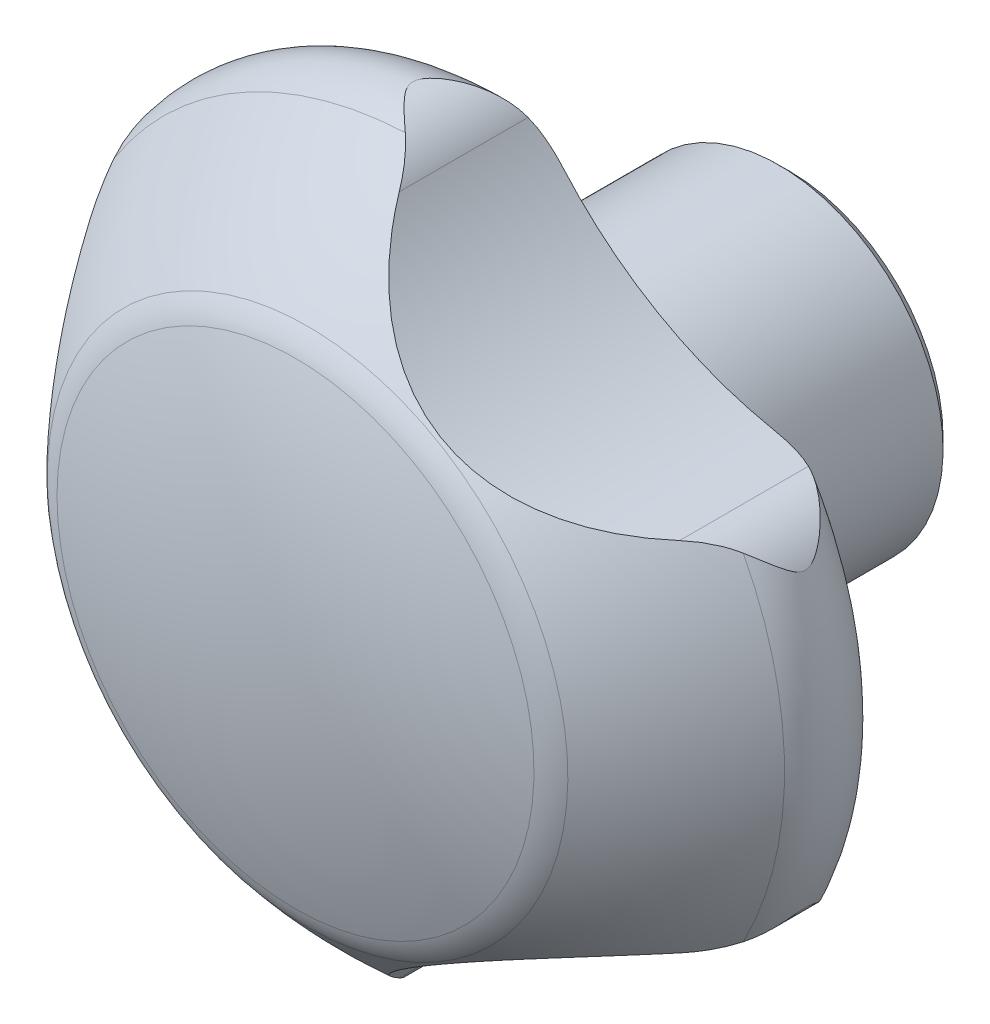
ISO-10303-21;
HEADER;
FILE_DESCRIPTION(('STEP AP214'),'2;1');
FILE_NAME('part.step','',(''),(''),'','','');
FILE_SCHEMA(('AUTOMOTIVE_DESIGN { 1 0 10303 214 1 1 1 1 }'));
ENDSEC;
DATA;
#1=APPLICATION_CONTEXT('core data for automotive mechanical design processes');
#2=APPLICATION_PROTOCOL_DEFINITION('international standard','automotive_design',2000,#1);
#3=PRODUCT_CONTEXT('',#1,'mechanical');
#4=PRODUCT('Part','Part','',(#3));
#5=PRODUCT_RELATED_PRODUCT_CATEGORY('part','',(#4));
#6=PRODUCT_DEFINITION_FORMATION('','',#4);
#7=PRODUCT_DEFINITION_CONTEXT('part definition',#1,'design');
#8=PRODUCT_DEFINITION('design','',#6,#7);
#9=PRODUCT_DEFINITION_SHAPE('','',#8);
#10=(LENGTH_UNIT() NAMED_UNIT(*) SI_UNIT(.MILLI.,.METRE.));
#11=(NAMED_UNIT(*) PLANE_ANGLE_UNIT() SI_UNIT($,.RADIAN.));
#12=(NAMED_UNIT(*) SI_UNIT($,.STERADIAN.) SOLID_ANGLE_UNIT());
#13=UNCERTAINTY_MEASURE_WITH_UNIT(LENGTH_MEASURE(1.E-05),#10,'distance_accuracy_value','');
#14=(GEOMETRIC_REPRESENTATION_CONTEXT(3) GLOBAL_UNCERTAINTY_ASSIGNED_CONTEXT((#13)) GLOBAL_UNIT_ASSIGNED_CONTEXT((#10,
#11,#12)) REPRESENTATION_CONTEXT('',''));
#15=CARTESIAN_POINT('',(0.,0.,0.));
#16=DIRECTION('',(0.,0.,1.));
#17=DIRECTION('',(1.,0.,0.));
#18=AXIS2_PLACEMENT_3D('',#15,#16,#17);
#19=CARTESIAN_POINT('',(0.,0.,14.375));
#20=DIRECTION('',(0.,0.,1.));
#21=DIRECTION('',(0.,-1.,0.));
#22=AXIS2_PLACEMENT_3D('',#19,#20,#21);
#23=TOROIDAL_SURFACE('',#22,13.125,2.875);
#24=CARTESIAN_POINT('',(0.,0.,11.5));
#25=DIRECTION('',(0.,0.,1.));
#26=DIRECTION('',(0.,-1.,0.));
#27=AXIS2_PLACEMENT_3D('',#24,#25,#26);
#28=CIRCLE('',#27,13.125);
#29=CARTESIAN_POINT('',(-12.0607651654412,-5.1772163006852,11.5));
#30=VERTEX_POINT('',#29);
#31=CARTESIAN_POINT('',(1.5467817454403,-13.0335371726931,11.5));
#32=VERTEX_POINT('',#31);
#33=EDGE_CURVE('E347',#30,#32,#28,.T.);
#34=ORIENTED_EDGE('',*,*,#33,.T.);
#35=CARTESIAN_POINT('',(12.3504229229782,-7.60476070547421,11.8522933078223));
#36=CARTESIAN_POINT('',(12.2372206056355,-7.6136079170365,11.8021242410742));
#37=CARTESIAN_POINT('',(12.1215849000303,-7.62389864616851,11.7580131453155));
#38=CARTESIAN_POINT('',(11.8871589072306,-7.64740774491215,11.68117773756));
#39=CARTESIAN_POINT('',(11.7683765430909,-7.66061928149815,11.6484273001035));
#40=CARTESIAN_POINT('',(11.5313012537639,-7.68974756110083,11.5939270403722));
#41=CARTESIAN_POINT('',(11.413048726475,-7.70560291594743,11.5719643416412));
#42=CARTESIAN_POINT('',(11.1755816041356,-7.74018356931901,11.5370888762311));
#43=CARTESIAN_POINT('',(11.0563664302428,-7.75891073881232,11.524182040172));
#44=CARTESIAN_POINT('',(10.7595038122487,-7.8090188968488,11.5021196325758));
#45=CARTESIAN_POINT('',(10.5817779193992,-7.84211070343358,11.4978813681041));
#46=CARTESIAN_POINT('',(10.2277731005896,-7.9142544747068,11.5040305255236));
#47=CARTESIAN_POINT('',(10.0514954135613,-7.95331107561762,11.5144293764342));
#48=CARTESIAN_POINT('',(9.69899926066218,-8.03765989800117,11.5468949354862));
#49=CARTESIAN_POINT('',(9.52281492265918,-8.08303046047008,11.5691200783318));
#50=CARTESIAN_POINT('',(9.17340527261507,-8.17934747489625,11.6221449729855));
#51=CARTESIAN_POINT('',(9.00017904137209,-8.23029215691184,11.6529420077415));
#52=CARTESIAN_POINT('',(8.54868011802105,-8.37135477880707,11.7411325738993));
#53=CARTESIAN_POINT('',(8.27272209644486,-8.46598921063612,11.8030864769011));
#54=CARTESIAN_POINT('',(7.86303063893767,-8.61907637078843,11.8968306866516));
#55=CARTESIAN_POINT('',(7.72708016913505,-8.67200254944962,11.9282367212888));
#56=CARTESIAN_POINT('',(7.45634930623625,-8.78169396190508,11.9894583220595));
#57=CARTESIAN_POINT('',(7.3215689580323,-8.83845934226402,12.0192738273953));
#58=CARTESIAN_POINT('',(7.05521634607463,-8.95498073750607,12.0748997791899));
#59=CARTESIAN_POINT('',(6.92362794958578,-9.01467153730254,12.100768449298));
#60=CARTESIAN_POINT('',(6.66136679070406,-9.13797315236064,12.147180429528));
#61=CARTESIAN_POINT('',(6.53069380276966,-9.20158296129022,12.1677250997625));
#62=CARTESIAN_POINT('',(6.27071311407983,-9.33257633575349,12.2017006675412));
#63=CARTESIAN_POINT('',(6.14140278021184,-9.3999498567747,12.2151495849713));
#64=CARTESIAN_POINT('',(5.88421167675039,-9.53847548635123,12.2337117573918));
#65=CARTESIAN_POINT('',(5.75633076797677,-9.60962722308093,12.2388258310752));
#66=CARTESIAN_POINT('',(5.50072525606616,-9.75647865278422,12.2401947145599));
#67=CARTESIAN_POINT('',(5.37302886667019,-9.83222871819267,12.236322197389));
#68=CARTESIAN_POINT('',(5.12020309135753,-9.98699196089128,12.219869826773));
#69=CARTESIAN_POINT('',(4.99507396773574,-10.0660054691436,12.2072890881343));
#70=CARTESIAN_POINT('',(4.74743521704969,-10.22720057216,12.174646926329));
#71=CARTESIAN_POINT('',(4.62493319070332,-10.3093898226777,12.1545662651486));
#72=CARTESIAN_POINT('',(4.38295146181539,-10.4766074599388,12.1087153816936));
#73=CARTESIAN_POINT('',(4.26347259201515,-10.5616366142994,12.0829436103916));
#74=CARTESIAN_POINT('',(4.02578640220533,-10.7357331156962,12.0272962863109));
#75=CARTESIAN_POINT('',(3.90762119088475,-10.8248406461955,11.9973676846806));
#76=CARTESIAN_POINT('',(3.67411545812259,-11.0060445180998,11.9357191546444));
#77=CARTESIAN_POINT('',(3.55877483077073,-11.0981407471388,11.9039992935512));
#78=CARTESIAN_POINT('',(3.21688385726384,-11.3789493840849,11.8091287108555));
#79=CARTESIAN_POINT('',(2.99411849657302,-11.5724352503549,11.7461743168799));
#80=CARTESIAN_POINT('',(2.65836230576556,-11.8808762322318,11.6605987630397));
#81=CARTESIAN_POINT('',(2.54214920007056,-11.9908709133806,11.632770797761));
#82=CARTESIAN_POINT('',(2.31233849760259,-12.2150585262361,11.5834795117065));
#83=CARTESIAN_POINT('',(2.19874166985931,-12.3292526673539,11.562018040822));
#84=CARTESIAN_POINT('',(1.97493262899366,-12.5611808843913,11.5277505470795));
#85=CARTESIAN_POINT('',(1.86470716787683,-12.6788960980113,11.5149048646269));
#86=CARTESIAN_POINT('',(1.64755158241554,-12.9179860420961,11.4999662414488));
#87=CARTESIAN_POINT('',(1.54062004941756,-13.039359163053,11.4978686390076));
#88=CARTESIAN_POINT('',(1.35689626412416,-13.2543800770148,11.5056455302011));
#89=CARTESIAN_POINT('',(1.27924001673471,-13.3473909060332,11.5126639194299));
#90=CARTESIAN_POINT('',(1.12650802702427,-13.5345845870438,11.5350756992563));
#91=CARTESIAN_POINT('',(1.05143277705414,-13.6287676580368,11.5504706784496));
#92=CARTESIAN_POINT('',(0.904544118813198,-13.8173259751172,11.5905636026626));
#93=CARTESIAN_POINT('',(0.832722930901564,-13.9117001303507,11.615237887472));
#94=CARTESIAN_POINT('',(0.692731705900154,-14.0998797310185,11.6747820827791));
#95=CARTESIAN_POINT('',(0.624558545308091,-14.1936855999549,11.7096431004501));
#96=CARTESIAN_POINT('',(0.533235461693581,-14.3221713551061,11.7653941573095));
#97=CARTESIAN_POINT('',(0.508262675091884,-14.3576157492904,11.7816303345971));
#98=CARTESIAN_POINT('',(0.45897269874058,-14.428172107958,11.8157367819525));
#99=CARTESIAN_POINT('',(0.434655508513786,-14.4632840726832,11.833607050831));
#100=CARTESIAN_POINT('',(0.410680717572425,-14.4981949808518,11.8523118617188));
#101=B_SPLINE_CURVE_WITH_KNOTS('',3,(#35,#36,#37,#38,#39,#40,#41,#42,#43,#44,#45,#46,#47,#48,
#49,#50,#51,#52,#53,#54,#55,#56,#57,#58,#59,#60,#61,#62,#63,#64,#65,#66,#67,#68,#69,#70,#71,#72,
#73,#74,#75,#76,#77,#78,#79,#80,#81,#82,#83,#84,#85,#86,#87,#88,#89,#90,#91,#92,#93,#94,#95,#96,
#97,#98,#99,#100),.UNSPECIFIED.,.F.,.F.,(4,2,2,2,2,2,2,2,2,2,2,2,2,2,2,2,2,2,2,2,2,2,2,2,2,2,2,
2,2,2,2,2,4),(0.,0.372049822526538,0.74323830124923,1.1067740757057,1.47054770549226,
2.01213205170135,2.55413951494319,3.10359804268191,3.65288260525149,4.54695277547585,
4.99461886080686,5.44230204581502,5.88256027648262,6.32270592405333,6.7617283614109,
7.20070767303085,7.6459445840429,8.09122676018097,8.53765906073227,8.98421302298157,
9.43710431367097,9.8899785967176,10.7944122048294,11.2815100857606,11.7687493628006,
12.2537301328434,12.7385005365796,13.1023365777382,13.4662416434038,13.8292250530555,
14.1918925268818,14.330759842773,14.4696270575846),.UNSPECIFIED.);
#102=CARTESIAN_POINT('',(0.41081806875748,-14.4979949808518,11.8522047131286));
#103=VERTEX_POINT('',#102);
#104=EDGE_CURVE('E157',#32,#103,#101,.T.);
#105=ORIENTED_EDGE('',*,*,#104,.T.);
#106=CARTESIAN_POINT('',(-0.660737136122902,-15.4768930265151,16.0083135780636));
#107=CARTESIAN_POINT('',(-0.743879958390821,-15.5235900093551,15.9355175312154));
#108=CARTESIAN_POINT('',(-0.82800121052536,-15.5658884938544,15.8610782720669));
#109=CARTESIAN_POINT('',(-0.997153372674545,-15.6420933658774,15.7083723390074));
#110=CARTESIAN_POINT('',(-1.08218640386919,-15.6759707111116,15.6300935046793));
#111=CARTESIAN_POINT('',(-1.25382578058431,-15.7362297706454,15.4674848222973));
#112=CARTESIAN_POINT('',(-1.34041230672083,-15.762383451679,15.3830484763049));
#113=CARTESIAN_POINT('',(-1.46752732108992,-15.7952896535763,15.2522937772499));
#114=CARTESIAN_POINT('',(-1.50940521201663,-15.8051988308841,15.2080632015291));
#115=CARTESIAN_POINT('',(-1.59162682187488,-15.8229807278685,15.11781274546));
#116=CARTESIAN_POINT('',(-1.63197112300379,-15.8308542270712,15.0717935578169));
#117=CARTESIAN_POINT('',(-1.70885295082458,-15.8444180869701,14.9788569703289));
#118=CARTESIAN_POINT('',(-1.74547114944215,-15.8501704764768,14.9320159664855));
#119=CARTESIAN_POINT('',(-1.81458696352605,-15.8599162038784,14.8352306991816));
#120=CARTESIAN_POINT('',(-1.84709237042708,-15.8639129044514,14.78529257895));
#121=CARTESIAN_POINT('',(-1.89627723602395,-15.8693447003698,14.6963386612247));
#122=CARTESIAN_POINT('',(-1.91480566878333,-15.8711870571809,14.658395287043));
#123=CARTESIAN_POINT('',(-1.9460747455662,-15.8740981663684,14.5801882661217));
#124=CARTESIAN_POINT('',(-1.95883515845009,-15.8751695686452,14.5399330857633));
#125=CARTESIAN_POINT('',(-1.97448778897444,-15.8764439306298,14.4659015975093));
#126=CARTESIAN_POINT('',(-1.97884771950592,-15.8767781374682,14.4324488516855));
#127=CARTESIAN_POINT('',(-1.98162234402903,-15.876993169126,14.3652926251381));
#128=CARTESIAN_POINT('',(-1.98003924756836,-15.8768741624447,14.3315892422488));
#129=CARTESIAN_POINT('',(-1.97125509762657,-15.8761807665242,14.2651289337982));
#130=CARTESIAN_POINT('',(-1.96408062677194,-15.8756085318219,14.2323682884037));
#131=CARTESIAN_POINT('',(-1.94520315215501,-15.8739968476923,14.1681959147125));
#132=CARTESIAN_POINT('',(-1.9334939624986,-15.8729567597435,14.1367860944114));
#133=CARTESIAN_POINT('',(-1.88636602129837,-15.8684052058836,14.0283531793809));
#134=CARTESIAN_POINT('',(-1.84214837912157,-15.8635511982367,13.9553463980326));
#135=CARTESIAN_POINT('',(-1.74486500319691,-15.8502796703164,13.8156392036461));
#136=CARTESIAN_POINT('',(-1.69172255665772,-15.8418301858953,13.7490020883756));
#137=CARTESIAN_POINT('',(-1.55697489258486,-15.8165202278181,13.5912869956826));
#138=CARTESIAN_POINT('',(-1.47316526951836,-15.7975931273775,13.5024135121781));
#139=CARTESIAN_POINT('',(-1.30259678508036,-15.7512723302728,13.3297547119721));
#140=CARTESIAN_POINT('',(-1.2158335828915,-15.7238656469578,13.2459774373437));
#141=CARTESIAN_POINT('',(-1.04187072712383,-15.6602989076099,13.0825576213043));
#142=CARTESIAN_POINT('',(-0.954671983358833,-15.6241527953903,13.0029087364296));
#143=CARTESIAN_POINT('',(-0.781286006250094,-15.5428179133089,12.8473483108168));
#144=CARTESIAN_POINT('',(-0.695098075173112,-15.49763582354,12.7714340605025));
#145=CARTESIAN_POINT('',(-0.537377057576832,-15.4052729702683,12.6343284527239));
#146=CARTESIAN_POINT('',(-0.465554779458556,-15.3593661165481,12.5726151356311));
#147=CARTESIAN_POINT('',(-0.324154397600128,-15.2606269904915,12.4522583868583));
#148=CARTESIAN_POINT('',(-0.254576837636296,-15.2077930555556,12.3936156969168));
#149=CARTESIAN_POINT('',(-0.0506782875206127,-15.0389726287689,12.2232234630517));
#150=CARTESIAN_POINT('',(0.0794541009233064,-14.9122996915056,12.1164528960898));
#151=CARTESIAN_POINT('',(0.237285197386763,-14.7285800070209,11.9894462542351));
#152=CARTESIAN_POINT('',(0.273356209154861,-14.684277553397,11.9606115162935));
#153=CARTESIAN_POINT('',(0.343614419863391,-14.5930239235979,11.9048672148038));
#154=CARTESIAN_POINT('',(0.377801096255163,-14.5460720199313,11.8779581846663));
#155=CARTESIAN_POINT('',(0.41095541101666,-14.4977949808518,11.8520975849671));
#156=B_SPLINE_CURVE_WITH_KNOTS('',3,(#106,#107,#108,#109,#110,#111,#112,#113,#114,#115,#116,
#117,#118,#119,#120,#121,#122,#123,#124,#125,#126,#127,#128,#129,#130,#131,#132,#133,#134,#135,
#136,#137,#138,#139,#140,#141,#142,#143,#144,#145,#146,#147,#148,#149,#150,#151,#152,#153,#154,
#155),.UNSPECIFIED.,.F.,.F.,(4,2,2,2,2,2,2,2,2,2,2,2,2,2,2,2,2,2,2,2,2,2,2,2,4),(0.,
0.359753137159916,0.720730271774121,1.09149073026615,1.27656973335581,1.46157775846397,
1.64064007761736,1.81935792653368,1.94585278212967,2.07191074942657,2.17263800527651,
2.27332781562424,2.37354182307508,2.47389301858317,2.72833085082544,2.98507953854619,
3.35522812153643,3.72594642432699,4.0960771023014,4.46593515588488,4.78133302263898,
5.09680672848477,5.72499481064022,5.9168974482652,6.10885303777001),.UNSPECIFIED.);
#157=CARTESIAN_POINT('',(-0.66096593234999,-15.4770214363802,16.0081135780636));
#158=VERTEX_POINT('',#157);
#159=EDGE_CURVE('E152',#158,#103,#156,.T.);
#160=ORIENTED_EDGE('',*,*,#159,.F.);
#161=CARTESIAN_POINT('',(0.,0.,16.0081135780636));
#162=DIRECTION('',(0.,0.,1.));
#163=DIRECTION('',(0.,-1.,0.));
#164=AXIS2_PLACEMENT_3D('',#161,#162,#163);
#165=CIRCLE('',#164,15.4911287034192);
#166=CARTESIAN_POINT('',(-13.0730107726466,-8.31092400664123,16.0081135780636));
#167=VERTEX_POINT('',#166);
#168=EDGE_CURVE('E353',#167,#158,#165,.T.);
#169=ORIENTED_EDGE('',*,*,#168,.F.);
#170=CARTESIAN_POINT('',(-12.760945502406,-6.89301860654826,11.8521068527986));
#171=CARTESIAN_POINT('',(-12.8017830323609,-6.97854374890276,11.8939661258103));
#172=CARTESIAN_POINT('',(-12.8382622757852,-7.06471054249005,11.9385721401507));
#173=CARTESIAN_POINT('',(-12.9028485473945,-7.23744731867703,12.0324783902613));
#174=CARTESIAN_POINT('',(-12.9309682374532,-7.32401648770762,12.0817713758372));
#175=CARTESIAN_POINT('',(-12.9792488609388,-7.49675384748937,12.1842720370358));
#176=CARTESIAN_POINT('',(-12.9994270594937,-7.58292250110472,12.2374709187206));
#177=CARTESIAN_POINT('',(-13.0323566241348,-7.75449014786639,12.3473575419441));
#178=CARTESIAN_POINT('',(-13.045104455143,-7.83988875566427,12.4040469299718));
#179=CARTESIAN_POINT('',(-13.0657398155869,-8.02893694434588,12.5339254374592));
#180=CARTESIAN_POINT('',(-13.0718239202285,-8.13224464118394,12.6079005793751));
#181=CARTESIAN_POINT('',(-13.0742285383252,-8.33593136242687,12.7599455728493));
#182=CARTESIAN_POINT('',(-13.070546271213,-8.43630954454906,12.8380165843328));
#183=CARTESIAN_POINT('',(-13.0543419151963,-8.63290872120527,12.9978699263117));
#184=CARTESIAN_POINT('',(-13.0418409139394,-8.72913905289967,13.0796429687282));
#185=CARTESIAN_POINT('',(-13.0090930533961,-8.91644401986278,13.2473439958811));
#186=CARTESIAN_POINT('',(-12.9888512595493,-9.00752198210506,13.3332692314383));
#187=CARTESIAN_POINT('',(-12.9507899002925,-9.15053180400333,13.4783287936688));
#188=CARTESIAN_POINT('',(-12.9347766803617,-9.20463195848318,13.5358125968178));
#189=CARTESIAN_POINT('',(-12.9009697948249,-9.30913269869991,13.6542498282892));
#190=CARTESIAN_POINT('',(-12.8831664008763,-9.35951016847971,13.715221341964));
#191=CARTESIAN_POINT('',(-12.846974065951,-9.45490323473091,13.8428458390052));
#192=CARTESIAN_POINT('',(-12.8285803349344,-9.49980871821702,13.9095799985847));
#193=CARTESIAN_POINT('',(-12.7951187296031,-9.57739439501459,14.0504700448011));
#194=CARTESIAN_POINT('',(-12.7800112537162,-9.61022388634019,14.124519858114));
#195=CARTESIAN_POINT('',(-12.7660356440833,-9.64003927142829,14.2377341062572));
#196=CARTESIAN_POINT('',(-12.762806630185,-9.64680761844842,14.2735996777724));
#197=CARTESIAN_POINT('',(-12.7592845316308,-9.65418525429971,14.3460725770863));
#198=CARTESIAN_POINT('',(-12.7589856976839,-9.65480660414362,14.3826783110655));
#199=CARTESIAN_POINT('',(-12.7613747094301,-9.64980872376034,14.4552528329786));
#200=CARTESIAN_POINT('',(-12.7640562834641,-9.64420259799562,14.4912227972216));
#201=CARTESIAN_POINT('',(-12.7717974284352,-9.62777513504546,14.5617242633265));
#202=CARTESIAN_POINT('',(-12.7768643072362,-9.61693776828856,14.5962509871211));
#203=CARTESIAN_POINT('',(-12.7932502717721,-9.58114238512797,14.6906772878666));
#204=CARTESIAN_POINT('',(-12.8063151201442,-9.55184677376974,14.7485677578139));
#205=CARTESIAN_POINT('',(-12.8340727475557,-9.4862850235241,14.8598696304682));
#206=CARTESIAN_POINT('',(-12.8487732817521,-9.44998502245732,14.9132573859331));
#207=CARTESIAN_POINT('',(-12.8881588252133,-9.34662069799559,15.052751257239));
#208=CARTESIAN_POINT('',(-12.9127203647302,-9.27563739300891,15.1359601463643));
#209=CARTESIAN_POINT('',(-12.9579023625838,-9.12687755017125,15.2973184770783));
#210=CARTESIAN_POINT('',(-12.9785147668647,-9.04908759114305,15.3754573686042));
#211=CARTESIAN_POINT('',(-13.0142869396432,-8.88880160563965,15.5279564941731));
#212=CARTESIAN_POINT('',(-13.0294508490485,-8.80630920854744,15.6023195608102));
#213=CARTESIAN_POINT('',(-13.0533966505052,-8.63779304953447,15.7478271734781));
#214=CARTESIAN_POINT('',(-13.0621858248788,-8.55177343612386,15.8189753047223));
#215=CARTESIAN_POINT('',(-13.0689856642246,-8.43894643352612,15.9088148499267));
#216=CARTESIAN_POINT('',(-13.0702194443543,-8.41342393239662,15.9289132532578));
#217=CARTESIAN_POINT('',(-13.0720765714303,-8.36218993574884,15.9688220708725));
#218=CARTESIAN_POINT('',(-13.0727007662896,-8.33647875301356,15.9886328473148));
#219=CARTESIAN_POINT('',(-13.0730139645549,-8.31066165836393,16.0083135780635));
#220=B_SPLINE_CURVE_WITH_KNOTS('',3,(#170,#171,#172,#173,#174,#175,#176,#177,#178,#179,#180,
#181,#182,#183,#184,#185,#186,#187,#188,#189,#190,#191,#192,#193,#194,#195,#196,#197,#198,#199,
#200,#201,#202,#203,#204,#205,#206,#207,#208,#209,#210,#211,#212,#213,#214,#215,#216,#217,#218,
#219),.UNSPECIFIED.,.F.,.F.,(4,2,2,2,2,2,2,2,2,2,2,2,2,2,2,2,2,2,2,2,2,2,2,2,4),(0.,
0.310578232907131,0.620683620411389,0.930111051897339,1.23968557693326,1.62078500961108,
2.00199295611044,2.38229242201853,2.76234345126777,3.00386840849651,3.24678519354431,
3.49398204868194,3.73801095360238,3.84737591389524,3.95652624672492,4.06544732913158,
4.17470430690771,4.37212988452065,4.57053496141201,4.90610543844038,5.24235317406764,
5.57834481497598,5.91395202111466,6.01147514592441,6.10886242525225),.UNSPECIFIED.);
#221=CARTESIAN_POINT('',(-12.7610409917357,-6.89321860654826,11.8522047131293));
#222=VERTEX_POINT('',#221);
#223=EDGE_CURVE('E147',#222,#167,#220,.T.);
#224=ORIENTED_EDGE('',*,*,#223,.F.);
#225=CARTESIAN_POINT('',(-12.7611364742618,-6.89341860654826,11.8523025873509));
#226=CARTESIAN_POINT('',(-12.7121972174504,-6.7909592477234,11.8021327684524));
#227=CARTESIAN_POINT('',(-12.6632913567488,-6.6856707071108,11.7580209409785));
#228=CARTESIAN_POINT('',(-12.5664377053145,-6.4708977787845,11.6811841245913));
#229=CARTESIAN_POINT('',(-12.5184879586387,-6.36142366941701,11.6484330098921));
#230=CARTESIAN_POINT('',(-12.4251759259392,-6.14154664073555,11.5939314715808));
#231=CARTESIAN_POINT('',(-12.3797806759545,-6.03120940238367,11.571968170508));
#232=CARTESIAN_POINT('',(-12.2909945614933,-5.80826672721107,11.5370915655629));
#233=CARTESIAN_POINT('',(-12.2476050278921,-5.69565985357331,11.5241841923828));
#234=CARTESIAN_POINT('',(-12.1425688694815,-5.41351699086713,11.502120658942));
#235=CARTESIAN_POINT('',(-12.0823645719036,-5.2430576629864,11.4978816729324));
#236=CARTESIAN_POINT('',(-11.9678409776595,-4.90041200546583,11.5040292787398));
#237=CARTESIAN_POINT('',(-11.9135263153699,-4.72822443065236,11.514427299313));
#238=CARTESIAN_POINT('',(-11.8103266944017,-4.38078277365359,11.5468911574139));
#239=CARTESIAN_POINT('',(-11.7615266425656,-4.20551907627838,11.5691154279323));
#240=CARTESIAN_POINT('',(-11.6702348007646,-3.85476632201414,11.6221386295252));
#241=CARTESIAN_POINT('',(-11.6277410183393,-3.67927735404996,11.6529348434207));
#242=CARTESIAN_POINT('',(-11.5241540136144,-3.21773619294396,11.7411243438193));
#243=CARTESIAN_POINT('',(-11.4681297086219,-2.93143031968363,11.8030783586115));
#244=CARTESIAN_POINT('',(-11.3958598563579,-2.50008056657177,11.896823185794));
#245=CARTESIAN_POINT('',(-11.3737195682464,-2.35587992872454,11.928229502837));
#246=CARTESIAN_POINT('',(-11.3333488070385,-2.06657244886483,11.9894517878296));
#247=CARTESIAN_POINT('',(-11.3151184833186,-1.92146557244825,12.0192676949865));
#248=CARTESIAN_POINT('',(-11.2828519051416,-1.63253480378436,12.074894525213));
#249=CARTESIAN_POINT('',(-11.268751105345,-1.48872954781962,12.1007636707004));
#250=CARTESIAN_POINT('',(-11.2444022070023,-1.19995197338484,12.1471766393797));
#251=CARTESIAN_POINT('',(-11.2341531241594,-1.05497996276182,12.1677218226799));
#252=CARTESIAN_POINT('',(-11.2176058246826,-0.764331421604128,12.2016983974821));
#253=CARTESIAN_POINT('',(-11.2112975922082,-0.618657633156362,12.2151478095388));
#254=CARTESIAN_POINT('',(-11.2026683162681,-0.32665876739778,12.2337108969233));
#255=CARTESIAN_POINT('',(-11.2003468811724,-0.180333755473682,12.238825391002));
#256=CARTESIAN_POINT('',(-11.1997208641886,0.11445499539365,12.2401949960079));
#257=CARTESIAN_POINT('',(-11.2014740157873,0.262919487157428,12.2363227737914));
#258=CARTESIAN_POINT('',(-11.2090898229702,0.559256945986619,12.2198708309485));
#259=CARTESIAN_POINT('',(-11.2149528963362,0.707129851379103,12.2072902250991));
#260=CARTESIAN_POINT('',(-11.2307324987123,1.0021911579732,12.1746481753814));
#261=CARTESIAN_POINT('',(-11.2406594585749,1.14937680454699,12.1545674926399));
#262=CARTESIAN_POINT('',(-11.2644833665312,1.44255023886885,12.1087164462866));
#263=CARTESIAN_POINT('',(-11.2783813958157,1.58853768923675,12.082944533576));
#264=CARTESIAN_POINT('',(-11.3103104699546,1.88143050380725,12.0272968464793));
#265=CARTESIAN_POINT('',(-11.3283973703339,2.02831949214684,11.9973680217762));
#266=CARTESIAN_POINT('',(-11.3685719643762,2.32114560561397,11.9357190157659));
#267=CARTESIAN_POINT('',(-11.3906595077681,2.46708276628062,11.9039989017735));
#268=CARTESIAN_POINT('',(-11.4629020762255,2.90357672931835,11.8091275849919));
#269=CARTESIAN_POINT('',(-11.5190836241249,3.19324235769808,11.7461727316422));
#270=CARTESIAN_POINT('',(-11.6183241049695,3.63823875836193,11.6605969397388));
#271=CARTESIAN_POINT('',(-11.655475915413,3.7938798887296,11.6327690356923));
#272=CARTESIAN_POINT('',(-11.734723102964,4.10499617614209,11.5834779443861));
#273=CARTESIAN_POINT('',(-11.7768199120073,4.26047127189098,11.5620166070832));
#274=CARTESIAN_POINT('',(-11.8657715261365,4.57026024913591,11.5277494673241));
#275=CARTESIAN_POINT('',(-11.9126033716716,4.72457617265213,11.5149040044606));
#276=CARTESIAN_POINT('',(-12.0110839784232,5.03218390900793,11.4999659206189));
#277=CARTESIAN_POINT('',(-12.0627306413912,5.18547613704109,11.4978686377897));
#278=CARTESIAN_POINT('',(-12.157082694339,5.45209638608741,11.5056461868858));
#279=CARTESIAN_POINT('',(-12.1988044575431,5.5658541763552,11.5126648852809));
#280=CARTESIAN_POINT('',(-12.2845532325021,5.7917209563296,11.5350773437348));
#281=CARTESIAN_POINT('',(-12.3285806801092,5.90382962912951,11.550472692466));
#282=CARTESIAN_POINT('',(-12.4184329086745,6.12531817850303,11.5905664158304));
#283=CARTESIAN_POINT('',(-12.4642528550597,6.23470424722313,11.6152411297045));
#284=CARTESIAN_POINT('',(-12.5572257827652,6.45002998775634,11.6747862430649));
#285=CARTESIAN_POINT('',(-12.604377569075,6.55597257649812,11.7096477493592));
#286=CARTESIAN_POINT('',(-12.6699855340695,6.6992979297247,11.7653973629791));
#287=CARTESIAN_POINT('',(-12.6881923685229,6.73864171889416,11.7816313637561));
#288=CARTESIAN_POINT('',(-12.7246459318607,6.81659551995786,11.8157330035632));
#289=CARTESIAN_POINT('',(-12.742892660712,6.85520553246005,11.8336006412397));
#290=CARTESIAN_POINT('',(-12.7611364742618,6.89341860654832,11.8523025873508));
#291=B_SPLINE_CURVE_WITH_KNOTS('',3,(#225,#226,#227,#228,#229,#230,#231,#232,#233,#234,#235,
#236,#237,#238,#239,#240,#241,#242,#243,#244,#245,#246,#247,#248,#249,#250,#251,#252,#253,#254,
#255,#256,#257,#258,#259,#260,#261,#262,#263,#264,#265,#266,#267,#268,#269,#270,#271,#272,#273,
#274,#275,#276,#277,#278,#279,#280,#281,#282,#283,#284,#285,#286,#287,#288,#289,#290),
.UNSPECIFIED.,.F.,.F.,(4,2,2,2,2,2,2,2,2,2,2,2,2,2,2,2,2,2,2,2,2,2,2,2,2,2,2,2,2,2,2,2,4),(0.,
0.372049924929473,0.743238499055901,1.10677437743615,1.47054811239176,2.01212737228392,
2.55412973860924,3.10358303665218,3.65286236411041,4.54693895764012,4.99460829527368,
5.44229473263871,5.8825561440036,6.32270497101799,6.76173054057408,7.20071298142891,
7.6459532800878,8.09123884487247,8.53767457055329,8.98423196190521,9.43712677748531,
9.89000458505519,10.7944452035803,11.2815439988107,11.7687841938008,12.2537658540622,
12.7385371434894,13.1023736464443,13.4662791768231,13.8292630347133,14.1919309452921,
14.3307790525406,14.4696270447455),.UNSPECIFIED.);
#292=EDGE_CURVE('E138',#222,#30,#291,.T.);
#293=ORIENTED_EDGE('',*,*,#292,.T.);
#294=EDGE_LOOP('',(#34,#105,#160,#169,#224,#293));
#295=FACE_BOUND('',#294,.T.);
#296=ADVANCED_FACE('F14',(#295),#23,.T.);
#297=CARTESIAN_POINT('',(0.410955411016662,14.4977949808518,11.8520975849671));
#298=CARTESIAN_POINT('',(0.357307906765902,14.5759240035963,11.8939562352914));
#299=CARTESIAN_POINT('',(0.30092556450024,14.6505995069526,11.9385616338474));
#300=CARTESIAN_POINT('',(0.18362557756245,14.792901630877,12.0324666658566));
#301=CARTESIAN_POINT('',(0.122714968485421,14.8605388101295,12.0817590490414));
#302=CARTESIAN_POINT('',(-0.00273837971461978,14.9887202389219,12.1842585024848));
#303=CARTESIAN_POINT('',(-0.0672728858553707,15.0492796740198,12.2374567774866));
#304=CARTESIAN_POINT('',(-0.199388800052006,15.1635819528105,12.347342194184));
#305=CARTESIAN_POINT('',(-0.266971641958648,15.2173215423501,12.4040309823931));
#306=CARTESIAN_POINT('',(-0.420373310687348,15.3297172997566,12.5339082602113));
#307=CARTESIAN_POINT('',(-0.506797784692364,15.3866407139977,12.6078827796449));
#308=CARTESIAN_POINT('',(-0.681992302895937,15.4905677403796,12.759926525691));
#309=CARTESIAN_POINT('',(-0.770763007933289,15.5375685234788,12.8379969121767));
#310=CARTESIAN_POINT('',(-0.949124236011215,15.6218360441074,12.9978489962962));
#311=CARTESIAN_POINT('',(-1.03871230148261,15.6591257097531,13.0796214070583));
#312=CARTESIAN_POINT('',(-1.21729657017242,15.7244191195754,13.2473210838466));
#313=CARTESIAN_POINT('',(-1.30629312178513,15.7524289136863,13.3332456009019));
#314=CARTESIAN_POINT('',(-1.44917526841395,15.7909732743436,13.4783051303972));
#315=CARTESIAN_POINT('',(-1.50403535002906,15.8041562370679,13.5357897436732));
#316=CARTESIAN_POINT('',(-1.61144191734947,15.8271303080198,13.654228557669));
#317=CARTESIAN_POINT('',(-1.66397325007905,15.8369014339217,13.7152008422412));
#318=CARTESIAN_POINT('',(-1.76468530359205,15.8532554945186,13.8428267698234));
#319=CARTESIAN_POINT('',(-1.81277306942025,15.8597792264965,13.909561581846));
#320=CARTESIAN_POINT('',(-1.89669874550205,15.8695941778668,14.050452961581));
#321=CARTESIAN_POINT('',(-1.9326857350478,15.8729257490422,14.124503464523));
#322=CARTESIAN_POINT('',(-1.9654974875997,15.8757305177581,14.2377187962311));
#323=CARTESIAN_POINT('',(-1.97297450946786,15.8763183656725,14.2735844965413));
#324=CARTESIAN_POINT('',(-1.98112668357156,15.8769571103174,14.3460578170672));
#325=CARTESIAN_POINT('',(-1.98181515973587,15.8770090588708,14.382663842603));
#326=CARTESIAN_POINT('',(-1.97629406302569,15.8765791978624,14.4552391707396));
#327=CARTESIAN_POINT('',(-1.97009896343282,15.8760985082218,14.4912096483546));
#328=CARTESIAN_POINT('',(-1.95200295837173,15.8745889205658,14.561712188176));
#329=CARTESIAN_POINT('',(-1.94008451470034,15.8735583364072,14.5962394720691));
#330=CARTESIAN_POINT('',(-1.90089391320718,15.8698515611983,14.6906643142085));
#331=CARTESIAN_POINT('',(-1.86899277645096,15.8665185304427,14.748553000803));
#332=CARTESIAN_POINT('',(-1.79833994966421,15.857777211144,14.8598514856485));
#333=CARTESIAN_POINT('',(-1.75955505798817,15.8523587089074,14.9132376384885));
#334=CARTESIAN_POINT('',(-1.6503512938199,15.834786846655,15.0527279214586));
#335=CARTESIAN_POINT('',(-1.57660012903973,15.8205671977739,15.1359348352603));
#336=CARTESIAN_POINT('',(-1.42518505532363,15.7853186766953,15.2972892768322));
#337=CARTESIAN_POINT('',(-1.34751354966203,15.7642761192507,15.3754262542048));
#338=CARTESIAN_POINT('',(-1.19082105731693,15.7151163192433,15.5279216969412));
#339=CARTESIAN_POINT('',(-1.11180114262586,15.6870044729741,15.602282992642));
#340=CARTESIAN_POINT('',(-0.953893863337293,15.6234886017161,15.7477872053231));
#341=CARTESIAN_POINT('',(-0.875006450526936,15.5880929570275,15.8189337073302));
#342=CARTESIAN_POINT('',(-0.773889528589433,15.5375674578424,15.9087791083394));
#343=CARTESIAN_POINT('',(-0.75116136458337,15.5258708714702,15.928884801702));
#344=CARTESIAN_POINT('',(-0.7058466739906,15.5018541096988,15.968807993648));
#345=CARTESIAN_POINT('',(-0.68325999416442,15.4895348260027,15.9886258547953));
#346=CARTESIAN_POINT('',(-0.660737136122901,15.4768930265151,16.0083135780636));
#347=B_SPLINE_CURVE_WITH_KNOTS('',3,(#297,#298,#299,#300,#301,#302,#303,#304,#305,#306,#307,
#308,#309,#310,#311,#312,#313,#314,#315,#316,#317,#318,#319,#320,#321,#322,#323,#324,#325,#326,
#327,#328,#329,#330,#331,#332,#333,#334,#335,#336,#337,#338,#339,#340,#341,#342,#343,#344,#345,
#346),.UNSPECIFIED.,.F.,.F.,(4,2,2,2,2,2,2,2,2,2,2,2,2,2,2,2,2,2,2,2,2,2,2,2,4),(0.,
0.31057668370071,0.620680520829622,0.930106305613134,1.23967918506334,1.62077715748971,
2.00198363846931,2.38228175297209,2.762331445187,3.00386128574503,3.2467828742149,
3.49398427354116,3.73801790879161,3.84738385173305,3.95653509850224,4.06545727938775,
4.17471538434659,4.37213334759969,4.5705307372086,4.90609058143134,5.24232769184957,
5.57830891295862,5.91390571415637,6.01146354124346,6.10888541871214),.UNSPECIFIED.);
#348=CARTESIAN_POINT('',(0.410818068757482,14.4979949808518,11.8522047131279));
#349=VERTEX_POINT('',#348);
#350=CARTESIAN_POINT('',(-0.660965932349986,15.4770214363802,16.0081135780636));
#351=VERTEX_POINT('',#350);
#352=EDGE_CURVE('E275',#349,#351,#347,.T.);
#353=ORIENTED_EDGE('',*,*,#352,.F.);
#354=CARTESIAN_POINT('',(0.410680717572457,14.4981949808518,11.8523118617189));
#355=CARTESIAN_POINT('',(0.474943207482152,14.4045828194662,11.802141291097));
#356=CARTESIAN_POINT('',(0.541672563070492,14.3095849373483,11.7580287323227));
#357=CARTESIAN_POINT('',(0.679244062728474,14.1183208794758,11.6811905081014));
#358=CARTESIAN_POINT('',(0.750076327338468,14.0220581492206,11.6484387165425));
#359=CARTESIAN_POINT('',(0.893839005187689,13.8313090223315,11.5939359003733));
#360=CARTESIAN_POINT('',(0.966696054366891,13.7368269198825,11.5719719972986));
#361=CARTESIAN_POINT('',(1.11537669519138,13.5484644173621,11.5370942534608));
#362=CARTESIAN_POINT('',(1.19120219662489,13.4545844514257,11.5241863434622));
#363=CARTESIAN_POINT('',(1.38302556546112,13.2225501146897,11.5021216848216));
#364=CARTESIAN_POINT('',(1.50054419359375,13.0851831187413,11.497881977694));
#365=CARTESIAN_POINT('',(1.74001954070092,12.8146820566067,11.5040280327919));
#366=CARTESIAN_POINT('',(1.86197965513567,12.6815513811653,11.5144252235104));
#367=CARTESIAN_POINT('',(2.11127033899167,12.4184589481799,11.5468873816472));
#368=CARTESIAN_POINT('',(2.23865168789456,12.2885659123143,11.5691107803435));
#369=CARTESIAN_POINT('',(2.49676363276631,12.0341301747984,11.6221322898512));
#370=CARTESIAN_POINT('',(2.62749315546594,11.9095857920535,11.6529276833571));
#371=CARTESIAN_POINT('',(2.97540561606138,11.5891049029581,11.741116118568));
#372=CARTESIAN_POINT('',(3.19534279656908,11.3974315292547,11.8030702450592));
#373=CARTESIAN_POINT('',(3.53276953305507,11.1191663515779,11.8968156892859));
#374=CARTESIAN_POINT('',(3.64658142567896,11.0278910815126,11.9282222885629));
#375=CARTESIAN_POINT('',(3.87694493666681,10.8482734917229,11.9894452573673));
#376=CARTESIAN_POINT('',(3.99349665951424,10.7599312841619,12.0192615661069));
#377=CARTESIAN_POINT('',(4.22758605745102,10.5875205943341,12.0748892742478));
#378=CARTESIAN_POINT('',(4.34507531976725,10.5034055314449,12.100758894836));
#379=CARTESIAN_POINT('',(4.58299094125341,10.3379284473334,12.1471728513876));
#380=CARTESIAN_POINT('',(4.70341654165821,10.2565657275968,12.1677185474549));
#381=CARTESIAN_POINT('',(4.94685334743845,10.096909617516,12.201696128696));
#382=CARTESIAN_POINT('',(5.06985716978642,10.018608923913,12.2151460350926));
#383=CARTESIAN_POINT('',(5.3184224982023,9.86513492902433,12.2337100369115));
#384=CARTESIAN_POINT('',(5.44398375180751,9.78996132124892,12.2388249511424));
#385=CARTESIAN_POINT('',(5.69896700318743,9.64202342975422,12.2401952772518));
#386=CARTESIAN_POINT('',(5.82841852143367,9.56930877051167,12.2363233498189));
#387=CARTESIAN_POINT('',(6.08886407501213,9.42773420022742,12.2198718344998));
#388=CARTESIAN_POINT('',(6.21985826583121,9.35887468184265,12.2072913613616));
#389=CARTESIAN_POINT('',(6.48328061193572,9.22500834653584,12.174649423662));
#390=CARTESIAN_POINT('',(6.61571159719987,9.16001194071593,12.154568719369));
#391=CARTESIAN_POINT('',(6.8815212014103,9.03405623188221,12.1087175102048));
#392=CARTESIAN_POINT('',(7.01490006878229,8.9730980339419,12.0829454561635));
#393=CARTESIAN_POINT('',(7.2845192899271,8.85430202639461,12.0272974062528));
#394=CARTESIAN_POINT('',(7.42077338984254,8.7965207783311,11.9973683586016));
#395=CARTESIAN_POINT('',(7.69445766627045,8.6848990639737,11.9357188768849));
#396=CARTESIAN_POINT('',(7.83188779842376,8.63105844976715,11.9039985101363));
#397=CARTESIAN_POINT('',(8.24602718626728,8.47537423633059,11.809126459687));
#398=CARTESIAN_POINT('',(8.52497796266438,8.37919543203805,11.7461711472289));
#399=CARTESIAN_POINT('',(8.95997899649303,8.24264148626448,11.6605951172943));
#400=CARTESIAN_POINT('',(9.11334441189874,8.19699534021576,11.6327672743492));
#401=CARTESIAN_POINT('',(9.42240329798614,8.11006730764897,11.5834763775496));
#402=CARTESIAN_POINT('',(9.57809743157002,8.06878669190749,11.5620151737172));
#403=CARTESIAN_POINT('',(9.89085904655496,7.99092663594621,11.5277483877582));
#404=CARTESIAN_POINT('',(10.0479168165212,7.95432629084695,11.5149031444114));
#405=CARTESIAN_POINT('',(10.3635538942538,7.88580925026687,11.4999655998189));
#406=CARTESIAN_POINT('',(10.5221325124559,7.85389053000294,11.497868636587));
#407=CARTESIAN_POINT('',(10.8002089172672,7.80229183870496,11.5056468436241));
#408=CARTESIAN_POINT('',(10.919587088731,7.78154513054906,11.5126658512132));
#409=CARTESIAN_POINT('',(11.1580681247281,7.74287252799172,11.5350789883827));
#410=CARTESIAN_POINT('',(11.2771709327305,7.72494716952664,11.5504747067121));
#411=CARTESIAN_POINT('',(11.5139119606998,7.69201739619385,11.5905692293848));
#412=CARTESIAN_POINT('',(11.6315531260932,7.67700569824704,11.6152443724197));
#413=CARTESIAN_POINT('',(11.864517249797,7.64985994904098,11.6747904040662));
#414=CARTESIAN_POINT('',(11.9798421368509,7.63772340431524,11.7096523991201));
#415=CARTESIAN_POINT('',(12.136763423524,7.62287961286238,11.7654005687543));
#416=CARTESIAN_POINT('',(12.179933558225,7.61897585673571,11.7816323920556));
#417=CARTESIAN_POINT('',(12.2656584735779,7.61156967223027,11.8157292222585));
#418=CARTESIAN_POINT('',(12.3082132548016,7.60806724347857,11.8335942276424));
#419=CARTESIAN_POINT('',(12.3504229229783,7.60476070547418,11.8522933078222));
#420=B_SPLINE_CURVE_WITH_KNOTS('',3,(#354,#355,#356,#357,#358,#359,#360,#361,#362,#363,#364,
#365,#366,#367,#368,#369,#370,#371,#372,#373,#374,#375,#376,#377,#378,#379,#380,#381,#382,#383,
#384,#385,#386,#387,#388,#389,#390,#391,#392,#393,#394,#395,#396,#397,#398,#399,#400,#401,#402,
#403,#404,#405,#406,#407,#408,#409,#410,#411,#412,#413,#414,#415,#416,#417,#418,#419),
.UNSPECIFIED.,.F.,.F.,(4,2,2,2,2,2,2,2,2,2,2,2,2,2,2,2,2,2,2,2,2,2,2,2,2,2,2,2,2,2,2,2,4),(0.,
0.372050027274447,0.74323869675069,1.1067746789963,1.47054851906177,2.01212269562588,
2.55411996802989,3.10356803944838,3.65284213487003,4.5469251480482,4.99459773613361,
5.44228742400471,5.88255201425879,6.32270401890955,6.76173271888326,7.20071828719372,
7.64596197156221,8.09125092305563,8.53769007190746,8.98425089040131,9.43714922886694,
9.89003055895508,10.7944781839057,11.2815778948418,11.7688190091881,12.2538015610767,
12.7385737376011,13.1024107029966,13.4663166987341,13.8293010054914,14.1919693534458,
14.3307982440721,14.4696270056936),.UNSPECIFIED.);
#421=CARTESIAN_POINT('',(1.5467817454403,13.0335371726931,11.5));
#422=VERTEX_POINT('',#421);
#423=EDGE_CURVE('E268',#349,#422,#420,.T.);
#424=ORIENTED_EDGE('',*,*,#423,.T.);
#425=CARTESIAN_POINT('',(-12.0607651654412,5.17721630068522,11.5));
#426=VERTEX_POINT('',#425);
#427=EDGE_CURVE('E135',#422,#426,#28,.T.);
#428=ORIENTED_EDGE('',*,*,#427,.T.);
#429=CARTESIAN_POINT('',(-12.7610409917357,6.89321860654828,11.8522047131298));
#430=VERTEX_POINT('',#429);
#431=EDGE_CURVE('E118',#426,#430,#291,.T.);
#432=ORIENTED_EDGE('',*,*,#431,.T.);
#433=CARTESIAN_POINT('',(-13.0730139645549,8.31066165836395,16.0083135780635));
#434=CARTESIAN_POINT('',(-13.0718833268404,8.40601394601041,15.9355175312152));
#435=CARTESIAN_POINT('',(-13.0664542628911,8.50001432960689,15.8610782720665));
#436=CARTESIAN_POINT('',(-13.0478735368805,8.68460683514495,15.7083723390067));
#437=CARTESIAN_POINT('',(-13.0346956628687,8.77518627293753,15.6300935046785));
#438=CARTESIAN_POINT('',(-13.0010618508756,8.95395986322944,15.4674848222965));
#439=CARTESIAN_POINT('',(-12.9804183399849,9.04202283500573,15.3830484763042));
#440=CARTESIAN_POINT('',(-12.9453584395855,9.16856076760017,15.2522937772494));
#441=CARTESIAN_POINT('',(-12.9330010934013,9.20978267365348,15.2080632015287));
#442=CARTESIAN_POINT('',(-12.9072898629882,9.28987962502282,15.1178127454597));
#443=CARTESIAN_POINT('',(-12.8939363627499,9.32875556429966,15.0717935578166));
#444=CARTESIAN_POINT('',(-12.8672420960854,9.40211911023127,14.9788569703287));
#445=CARTESIAN_POINT('',(-12.8539147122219,9.43670759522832,14.9320159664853));
#446=CARTESIAN_POINT('',(-12.827796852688,9.50143650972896,14.8352306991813));
#447=CARTESIAN_POINT('',(-12.8150053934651,9.5315853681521,14.7852925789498));
#448=CARTESIAN_POINT('',(-12.7951170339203,9.57689660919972,14.6963386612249));
#449=CARTESIAN_POINT('',(-12.7874483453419,9.59386388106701,14.6583952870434));
#450=CARTESIAN_POINT('',(-12.77433490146,9.62239925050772,14.5801882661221));
#451=CARTESIAN_POINT('',(-12.7688825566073,9.63398579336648,14.5399330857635));
#452=CARTESIAN_POINT('',(-12.7621598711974,9.64817855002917,14.4659015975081));
#453=CARTESIAN_POINT('',(-12.7602693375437,9.65212146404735,14.4324488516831));
#454=CARTESIAN_POINT('',(-12.7590682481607,9.65463187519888,14.3652926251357));
#455=CARTESIAN_POINT('',(-12.7597567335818,9.65320137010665,14.3315892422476));
#456=CARTESIAN_POINT('',(-12.7635483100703,9.64524737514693,14.2651289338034));
#457=CARTESIAN_POINT('',(-12.7666399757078,9.63874798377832,14.2323682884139));
#458=CARTESIAN_POINT('',(-12.7746829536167,9.62159376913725,14.1681959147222));
#459=CARTESIAN_POINT('',(-12.7796368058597,9.6109332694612,14.1367860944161));
#460=CARTESIAN_POINT('',(-12.7992590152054,9.56784349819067,14.0283531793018));
#461=CARTESIAN_POINT('',(-12.8171641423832,9.52712289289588,13.9553463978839));
#462=CARTESIAN_POINT('',(-12.854312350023,9.43623725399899,13.8156392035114));
#463=CARTESIAN_POINT('',(-12.8735661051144,9.38598980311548,13.7490020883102));
#464=CARTESIAN_POINT('',(-12.9190208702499,9.25663992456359,13.5912869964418));
#465=CARTESIAN_POINT('',(-12.9445343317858,9.17459511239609,13.5024135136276));
#466=CARTESIAN_POINT('',(-12.9897035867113,9.00371807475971,13.3297547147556));
#467=CARTESIAN_POINT('',(-13.0093503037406,8.91487559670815,13.2459774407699));
#468=CARTESIAN_POINT('',(-13.0412813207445,8.73243597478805,13.0825576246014));
#469=CARTESIAN_POINT('',(-13.0535772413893,8.63884659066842,13.00290873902));
#470=CARTESIAN_POINT('',(-13.0698321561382,8.44802248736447,12.8473483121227));
#471=CARTESIAN_POINT('',(-13.073797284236,8.35079050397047,12.7714340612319));
#472=CARTESIAN_POINT('',(-13.0726692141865,8.1680184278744,12.6343282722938));
#473=CARTESIAN_POINT('',(-13.0688238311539,8.08286483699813,12.5726147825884));
#474=CARTESIAN_POINT('',(-13.0540133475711,7.91103845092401,12.4522577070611));
#475=CARTESIAN_POINT('',(-13.0430465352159,7.82436529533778,12.3936148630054));
#476=CARTESIAN_POINT('',(-12.9987927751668,7.563372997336,12.2232222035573));
#477=CARTESIAN_POINT('',(-12.9541567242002,7.38733805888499,12.1164513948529));
#478=CARTESIAN_POINT('',(-12.8739672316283,7.15879569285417,11.9894466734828));
#479=CARTESIAN_POINT('',(-12.8536371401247,7.10540973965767,11.9606139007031));
#480=CARTESIAN_POINT('',(-12.8097416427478,6.99894485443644,11.9048732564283));
#481=CARTESIAN_POINT('',(-12.7861753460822,6.94586601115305,11.8779659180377));
#482=CARTESIAN_POINT('',(-12.760945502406,6.89301860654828,11.8521068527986));
#483=B_SPLINE_CURVE_WITH_KNOTS('',3,(#433,#434,#435,#436,#437,#438,#439,#440,#441,#442,#443,
#444,#445,#446,#447,#448,#449,#450,#451,#452,#453,#454,#455,#456,#457,#458,#459,#460,#461,#462,
#463,#464,#465,#466,#467,#468,#469,#470,#471,#472,#473,#474,#475,#476,#477,#478,#479,#480,#481,
#482),.UNSPECIFIED.,.F.,.F.,(4,2,2,2,2,2,2,2,2,2,2,2,2,2,2,2,2,2,2,2,2,2,2,2,4),(0.,
0.359753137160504,0.720730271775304,1.09149073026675,1.27656973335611,1.46157775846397,
1.64064007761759,1.81935792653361,1.94585278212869,2.07191074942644,2.17263800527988,
2.2733278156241,2.37354182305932,2.47389301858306,2.72833085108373,2.9850795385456,
3.35522811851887,3.72594641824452,4.09607709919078,4.46593515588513,4.78133392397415,
5.09680853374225,5.72499838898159,5.91688777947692,6.10883009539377),.UNSPECIFIED.);
#484=CARTESIAN_POINT('',(-13.0730107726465,8.31092400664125,16.0081135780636));
#485=VERTEX_POINT('',#484);
#486=EDGE_CURVE('E107',#485,#430,#483,.T.);
#487=ORIENTED_EDGE('',*,*,#486,.F.);
#488=EDGE_CURVE('E351',#351,#485,#165,.T.);
#489=ORIENTED_EDGE('',*,*,#488,.F.);
#490=EDGE_LOOP('',(#353,#424,#428,#432,#487,#489));
#491=FACE_BOUND('',#490,.T.);
#492=ADVANCED_FACE('F132',(#491),#23,.T.);
#493=CARTESIAN_POINT('',(0.,0.,0.));
#494=DIRECTION('',(0.,0.,1.));
#495=DIRECTION('',(0.,-1.,0.));
#496=AXIS2_PLACEMENT_3D('',#493,#494,#495);
#497=PLANE('',#496);
#498=CARTESIAN_POINT('',(0.,0.,0.));
#499=DIRECTION('',(0.,0.,1.));
#500=DIRECTION('',(0.,-1.,0.));
#501=AXIS2_PLACEMENT_3D('',#498,#499,#500);
#502=CIRCLE('',#501,5.);
#503=CARTESIAN_POINT('',(0.,-5.,0.));
#504=VERTEX_POINT('',#503);
#505=EDGE_CURVE('E370',#504,#504,#502,.T.);
#506=ORIENTED_EDGE('',*,*,#505,.F.);
#507=EDGE_LOOP('',(#506));
#508=FACE_BOUND('',#507,.T.);
#509=CARTESIAN_POINT('',(0.,0.,0.));
#510=DIRECTION('',(0.,0.,-1.));
#511=DIRECTION('',(0.,1.,0.));
#512=AXIS2_PLACEMENT_3D('',#509,#510,#511);
#513=CIRCLE('',#512,3.);
#514=CARTESIAN_POINT('',(0.,3.,0.));
#515=VERTEX_POINT('',#514);
#516=EDGE_CURVE('E398',#515,#515,#513,.T.);
#517=ORIENTED_EDGE('',*,*,#516,.F.);
#518=EDGE_LOOP('',(#517));
#519=FACE_BOUND('',#518,.T.);
#520=ADVANCED_FACE('F16',(#508,#519),#497,.F.);
#521=CARTESIAN_POINT('',(0.,0.,23.));
#522=DIRECTION('',(0.,0.,1.));
#523=DIRECTION('',(0.,-1.,0.));
#524=AXIS2_PLACEMENT_3D('',#521,#522,#523);
#525=CYLINDRICAL_SURFACE('',#524,5.);
#526=CARTESIAN_POINT('',(0.,0.,0.3));
#527=DIRECTION('',(0.,0.,1.));
#528=DIRECTION('',(0.,-1.,0.));
#529=AXIS2_PLACEMENT_3D('',#526,#527,#528);
#530=CIRCLE('',#529,5.);
#531=CARTESIAN_POINT('',(0.,-5.,0.3));
#532=VERTEX_POINT('',#531);
#533=EDGE_CURVE('E368',#532,#532,#530,.T.);
#534=ORIENTED_EDGE('',*,*,#533,.F.);
#535=EDGE_LOOP('',(#534));
#536=FACE_BOUND('',#535,.T.);
#537=ORIENTED_EDGE('',*,*,#505,.T.);
#538=EDGE_LOOP('',(#537));
#539=FACE_BOUND('',#538,.T.);
#540=ADVANCED_FACE('F411',(#536,#539),#525,.T.);
#541=CARTESIAN_POINT('',(5.,0.,0.3));
#542=DIRECTION('',(0.,0.,1.));
#543=DIRECTION('',(0.,-1.,0.));
#544=AXIS2_PLACEMENT_3D('',#541,#542,#543);
#545=PLANE('',#544);
#546=CARTESIAN_POINT('',(0.,0.,0.3));
#547=DIRECTION('',(0.,0.,1.));
#548=DIRECTION('',(0.,-1.,0.));
#549=AXIS2_PLACEMENT_3D('',#546,#547,#548);
#550=CIRCLE('',#549,6.53333333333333);
#551=CARTESIAN_POINT('',(0.,-6.53333333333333,0.3));
#552=VERTEX_POINT('',#551);
#553=EDGE_CURVE('E365',#552,#552,#550,.T.);
#554=ORIENTED_EDGE('',*,*,#553,.F.);
#555=EDGE_LOOP('',(#554));
#556=FACE_BOUND('',#555,.T.);
#557=ORIENTED_EDGE('',*,*,#533,.T.);
#558=EDGE_LOOP('',(#557));
#559=FACE_BOUND('',#558,.T.);
#560=ADVANCED_FACE('F416',(#556,#559),#545,.F.);
#561=CARTESIAN_POINT('',(0.,0.,0.3));
#562=DIRECTION('',(0.,0.,1.));
#563=DIRECTION('',(0.,-1.,0.));
#564=AXIS2_PLACEMENT_3D('',#561,#562,#563);
#565=CONICAL_SURFACE('',#564,6.53333333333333,0.785398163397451);
#566=CARTESIAN_POINT('',(0.,0.,0.766666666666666));
#567=DIRECTION('',(0.,0.,1.));
#568=DIRECTION('',(0.,-1.,0.));
#569=AXIS2_PLACEMENT_3D('',#566,#567,#568);
#570=CIRCLE('',#569,7.);
#571=CARTESIAN_POINT('',(0.,-7.,0.766666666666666));
#572=VERTEX_POINT('',#571);
#573=EDGE_CURVE('E360',#572,#572,#570,.T.);
#574=ORIENTED_EDGE('',*,*,#573,.F.);
#575=EDGE_LOOP('',(#574));
#576=FACE_BOUND('',#575,.T.);
#577=ORIENTED_EDGE('',*,*,#553,.T.);
#578=EDGE_LOOP('',(#577));
#579=FACE_BOUND('',#578,.T.);
#580=ADVANCED_FACE('F421',(#576,#579),#565,.T.);
#581=CARTESIAN_POINT('',(0.,0.,23.));
#582=DIRECTION('',(0.,0.,1.));
#583=DIRECTION('',(0.,-1.,0.));
#584=AXIS2_PLACEMENT_3D('',#581,#582,#583);
#585=CYLINDRICAL_SURFACE('',#584,7.);
#586=CARTESIAN_POINT('',(0.,0.,10.1));
#587=DIRECTION('',(0.,0.,1.));
#588=DIRECTION('',(0.,-1.,0.));
#589=AXIS2_PLACEMENT_3D('',#586,#587,#588);
#590=CIRCLE('',#589,7.);
#591=CARTESIAN_POINT('',(0.,-7.,10.1));
#592=VERTEX_POINT('',#591);
#593=EDGE_CURVE('E357',#592,#592,#590,.T.);
#594=ORIENTED_EDGE('',*,*,#593,.F.);
#595=EDGE_LOOP('',(#594));
#596=FACE_BOUND('',#595,.T.);
#597=ORIENTED_EDGE('',*,*,#573,.T.);
#598=EDGE_LOOP('',(#597));
#599=FACE_BOUND('',#598,.T.);
#600=ADVANCED_FACE('F428',(#596,#599),#585,.T.);
#601=CARTESIAN_POINT('',(0.,0.,10.1));
#602=DIRECTION('',(0.,0.,1.));
#603=DIRECTION('',(0.,-1.,0.));
#604=AXIS2_PLACEMENT_3D('',#601,#602,#603);
#605=TOROIDAL_SURFACE('',#604,8.4,1.4);
#606=CARTESIAN_POINT('',(0.,0.,11.5));
#607=DIRECTION('',(0.,0.,1.));
#608=DIRECTION('',(0.,-1.,0.));
#609=AXIS2_PLACEMENT_3D('',#606,#607,#608);
#610=CIRCLE('',#609,8.4);
#611=CARTESIAN_POINT('',(0.,-8.4,11.5));
#612=VERTEX_POINT('',#611);
#613=EDGE_CURVE('E355',#612,#612,#610,.T.);
#614=ORIENTED_EDGE('',*,*,#613,.F.);
#615=EDGE_LOOP('',(#614));
#616=FACE_BOUND('',#615,.T.);
#617=ORIENTED_EDGE('',*,*,#593,.T.);
#618=EDGE_LOOP('',(#617));
#619=FACE_BOUND('',#618,.T.);
#620=ADVANCED_FACE('F309',(#616,#619),#605,.F.);
#621=CARTESIAN_POINT('',(8.4,0.,11.5));
#622=DIRECTION('',(0.,0.,1.));
#623=DIRECTION('',(0.,-1.,0.));
#624=AXIS2_PLACEMENT_3D('',#621,#622,#623);
#625=PLANE('',#624);
#626=CARTESIAN_POINT('',(10.5139834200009,-7.85632087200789,11.5));
#627=VERTEX_POINT('',#626);
#628=CARTESIAN_POINT('',(10.5139834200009,7.85632087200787,11.5));
#629=VERTEX_POINT('',#628);
#630=EDGE_CURVE('E349',#627,#629,#28,.T.);
#631=ORIENTED_EDGE('',*,*,#630,.F.);
#632=CARTESIAN_POINT('',(13.6,-23.5558909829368,11.5));
#633=DIRECTION('',(0.,0.,1.));
#634=DIRECTION('',(0.,-1.,0.));
#635=AXIS2_PLACEMENT_3D('',#632,#633,#634);
#636=CIRCLE('',#635,16.);
#637=EDGE_CURVE('E323',#32,#627,#636,.F.);
#638=ORIENTED_EDGE('',*,*,#637,.F.);
#639=ORIENTED_EDGE('',*,*,#33,.F.);
#640=CARTESIAN_POINT('',(-27.2,0.,11.5));
#641=DIRECTION('',(0.,0.,1.));
#642=DIRECTION('',(0.,-1.,0.));
#643=AXIS2_PLACEMENT_3D('',#640,#641,#642);
#644=CIRCLE('',#643,16.);
#645=EDGE_CURVE('E136',#426,#30,#644,.F.);
#646=ORIENTED_EDGE('',*,*,#645,.F.);
#647=ORIENTED_EDGE('',*,*,#427,.F.);
#648=CARTESIAN_POINT('',(13.6,23.5558909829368,11.5));
#649=DIRECTION('',(0.,0.,1.));
#650=DIRECTION('',(0.,-1.,0.));
#651=AXIS2_PLACEMENT_3D('',#648,#649,#650);
#652=CIRCLE('',#651,16.);
#653=EDGE_CURVE('E266',#629,#422,#652,.F.);
#654=ORIENTED_EDGE('',*,*,#653,.F.);
#655=EDGE_LOOP('',(#631,#638,#639,#646,#647,#654));
#656=FACE_BOUND('',#655,.T.);
#657=ORIENTED_EDGE('',*,*,#613,.T.);
#658=EDGE_LOOP('',(#657));
#659=FACE_BOUND('',#658,.T.);
#660=ADVANCED_FACE('F304',(#656,#659),#625,.F.);
#661=CARTESIAN_POINT('',(12.3500229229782,-7.60479203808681,11.852116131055));
#662=CARTESIAN_POINT('',(12.444508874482,-7.59739516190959,11.8939760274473));
#663=CARTESIAN_POINT('',(12.5373713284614,-7.58590305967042,11.9385826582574));
#664=CARTESIAN_POINT('',(12.7192592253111,-7.5554666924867,12.032490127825));
#665=CARTESIAN_POINT('',(12.8082902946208,-7.53653379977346,12.0817837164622));
#666=CARTESIAN_POINT('',(12.9820257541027,-7.49197600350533,12.1842855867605));
#667=CARTESIAN_POINT('',(13.066739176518,-7.46636581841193,12.2374850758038));
#668=CARTESIAN_POINT('',(13.2317859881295,-7.40909844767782,12.3473729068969));
#669=CARTESIAN_POINT('',(13.3121172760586,-7.3774383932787,12.4040628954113));
#670=CARTESIAN_POINT('',(13.4861552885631,-7.30078355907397,12.5339426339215));
#671=CARTESIAN_POINT('',(13.5786642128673,-7.25439792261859,12.6079183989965));
#672=CARTESIAN_POINT('',(13.7562638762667,-7.15463551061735,12.759964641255));
#673=CARTESIAN_POINT('',(13.8413524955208,-7.10125674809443,12.8380362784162));
#674=CARTESIAN_POINT('',(14.0035094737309,-6.98892239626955,12.9978908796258));
#675=CARTESIAN_POINT('',(14.0805964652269,-6.9299804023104,13.0796645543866));
#676=CARTESIAN_POINT('',(14.2264324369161,-6.80796628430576,13.2473669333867));
#677=CARTESIAN_POINT('',(14.2951868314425,-6.74489688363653,13.3332928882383));
#678=CARTESIAN_POINT('',(14.400004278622,-6.64043024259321,13.4783524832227));
#679=CARTESIAN_POINT('',(14.4388484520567,-6.59951312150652,13.535835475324));
#680=CARTESIAN_POINT('',(14.5124427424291,-6.51798692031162,13.6542711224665));
#681=CARTESIAN_POINT('',(14.5471679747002,-6.47738097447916,13.7152418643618));
#682=CARTESIAN_POINT('',(14.6116822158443,-6.39834311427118,13.842864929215));
#683=CARTESIAN_POINT('',(14.6413734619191,-6.35996211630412,13.9095984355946));
#684=CARTESIAN_POINT('',(14.691831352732,-6.29219353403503,14.0504871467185));
#685=CARTESIAN_POINT('',(14.7127075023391,-6.26269699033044,14.1245362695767));
#686=CARTESIAN_POINT('',(14.731538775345,-6.23568856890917,14.2377494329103));
#687=CARTESIAN_POINT('',(14.7357852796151,-6.22950877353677,14.2736148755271));
#688=CARTESIAN_POINT('',(14.7404123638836,-6.22277130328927,14.3460873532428));
#689=CARTESIAN_POINT('',(14.7408005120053,-6.22220262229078,14.3826927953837));
#690=CARTESIAN_POINT('',(14.7376657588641,-6.22677191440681,14.4552665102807));
#691=CARTESIAN_POINT('',(14.734151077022,-6.23189789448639,14.4912359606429));
#692=CARTESIAN_POINT('',(14.7237943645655,-6.24681660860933,14.5617363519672));
#693=CARTESIAN_POINT('',(14.7169421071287,-6.25662368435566,14.5962625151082));
#694=CARTESIAN_POINT('',(14.694134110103,-6.28871372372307,14.6906902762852));
#695=CARTESIAN_POINT('',(14.6752945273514,-6.31467763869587,14.7485825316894));
#696=CARTESIAN_POINT('',(14.6323924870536,-6.37150053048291,14.8598877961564));
#697=CARTESIAN_POINT('',(14.608304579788,-6.40238315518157,14.9132771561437));
#698=CARTESIAN_POINT('',(14.5384774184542,-6.48817794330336,15.0527746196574));
#699=CARTESIAN_POINT('',(14.4892824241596,-6.54494252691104,15.1359854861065));
#700=CARTESIAN_POINT('',(14.3830384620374,-6.65845484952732,15.2973477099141));
#701=CARTESIAN_POINT('',(14.3259738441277,-6.71520232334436,15.3754885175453));
#702=CARTESIAN_POINT('',(14.2050424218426,-6.8263277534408,15.5279913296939));
#703=CARTESIAN_POINT('',(14.1411808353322,-6.88070748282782,15.6023561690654));
#704=CARTESIAN_POINT('',(14.0072080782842,-6.98570520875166,15.7478671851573));
#705=CARTESIAN_POINT('',(13.937104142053,-7.03632743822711,15.8190169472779));
#706=CARTESIAN_POINT('',(13.8427967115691,-7.09862502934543,15.9088506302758));
#707=CARTESIAN_POINT('',(13.8213178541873,-7.11244962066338,15.9289417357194));
#708=CARTESIAN_POINT('',(13.7778915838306,-7.13966495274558,15.9688361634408));
#709=CARTESIAN_POINT('',(13.7559448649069,-7.15305627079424,15.988639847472));
#710=CARTESIAN_POINT('',(13.7337511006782,-7.16623136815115,16.0083135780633));
#711=B_SPLINE_CURVE_WITH_KNOTS('',3,(#661,#662,#663,#664,#665,#666,#667,#668,#669,#670,#671,
#672,#673,#674,#675,#676,#677,#678,#679,#680,#681,#682,#683,#684,#685,#686,#687,#688,#689,#690,
#691,#692,#693,#694,#695,#696,#697,#698,#699,#700,#701,#702,#703,#704,#705,#706,#707,#708,#709,
#710),.UNSPECIFIED.,.F.,.F.,(4,2,2,2,2,2,2,2,2,2,2,2,2,2,2,2,2,2,2,2,2,2,2,2,4),(0.,
0.3105797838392,0.620686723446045,0.930115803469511,1.23969197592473,1.6207928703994,
2.00200228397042,2.38230310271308,2.76235547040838,3.00387553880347,3.24678751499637,
3.49397982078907,3.73800399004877,3.84736796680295,3.95651738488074,4.06543736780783,
4.17469321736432,4.37212641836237,4.57053919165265,4.90612031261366,5.24237868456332,
5.57838075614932,5.91399837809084,6.01148676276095,6.10883940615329),.UNSPECIFIED.);
#712=CARTESIAN_POINT('',(12.3502229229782,-7.60477637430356,11.85220471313));
#713=VERTEX_POINT('',#712);
#714=CARTESIAN_POINT('',(13.7339767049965,-7.16609742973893,16.0081135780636));
#715=VERTEX_POINT('',#714);
#716=EDGE_CURVE('E314',#713,#715,#711,.T.);
#717=ORIENTED_EDGE('',*,*,#716,.F.);
#718=EDGE_CURVE('E316',#713,#627,#101,.T.);
#719=ORIENTED_EDGE('',*,*,#718,.T.);
#720=ORIENTED_EDGE('',*,*,#630,.T.);
#721=CARTESIAN_POINT('',(12.3502229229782,7.60477637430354,11.8522047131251));
#722=VERTEX_POINT('',#721);
#723=EDGE_CURVE('E258',#629,#722,#420,.T.);
#724=ORIENTED_EDGE('',*,*,#723,.T.);
#725=CARTESIAN_POINT('',(13.7337511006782,7.16623136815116,16.0083135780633));
#726=CARTESIAN_POINT('',(13.8157632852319,7.1175760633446,15.9355175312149));
#727=CARTESIAN_POINT('',(13.8944554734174,7.06587416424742,15.861078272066));
#728=CARTESIAN_POINT('',(14.0450269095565,6.95748653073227,15.708372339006));
#729=CARTESIAN_POINT('',(14.1168820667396,6.90078443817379,15.6300935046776));
#730=CARTESIAN_POINT('',(14.2548876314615,6.78226990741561,15.4674848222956));
#731=CARTESIAN_POINT('',(14.320830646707,6.72036061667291,15.3830484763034));
#732=CARTESIAN_POINT('',(14.4128857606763,6.62672888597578,15.2522937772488));
#733=CARTESIAN_POINT('',(14.4424063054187,6.59541615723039,15.2080632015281));
#734=CARTESIAN_POINT('',(14.4989166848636,6.53310110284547,15.1178127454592));
#735=CARTESIAN_POINT('',(14.5259074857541,6.5020986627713,15.0717935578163));
#736=CARTESIAN_POINT('',(14.5760950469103,6.44229897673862,14.9788569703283));
#737=CARTESIAN_POINT('',(14.5993858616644,6.41346288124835,14.9320159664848));
#738=CARTESIAN_POINT('',(14.6423838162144,6.35847969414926,14.8352306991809));
#739=CARTESIAN_POINT('',(14.6620977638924,6.33232753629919,14.7852925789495));
#740=CARTESIAN_POINT('',(14.6913942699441,6.29244809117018,14.6963386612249));
#741=CARTESIAN_POINT('',(14.7022540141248,6.27732317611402,14.6583952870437));
#742=CARTESIAN_POINT('',(14.720409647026,6.25169891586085,14.5801882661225));
#743=CARTESIAN_POINT('',(14.7277177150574,6.24118377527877,14.5399330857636));
#744=CARTESIAN_POINT('',(14.7366476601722,6.22826538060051,14.4659015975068));
#745=CARTESIAN_POINT('',(14.7391170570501,6.22465667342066,14.4324488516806));
#746=CARTESIAN_POINT('',(14.7406905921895,6.22236129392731,14.3652926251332));
#747=CARTESIAN_POINT('',(14.7397959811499,6.2236727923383,14.3315892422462));
#748=CARTESIAN_POINT('',(14.7348034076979,6.23093339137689,14.2651289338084));
#749=CARTESIAN_POINT('',(14.7307206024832,6.236860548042,14.2323682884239));
#750=CARTESIAN_POINT('',(14.7198861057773,6.25240307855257,14.1681959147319));
#751=CARTESIAN_POINT('',(14.7131307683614,6.26202349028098,14.1367860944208));
#752=CARTESIAN_POINT('',(14.6856250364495,6.30056170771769,14.0283531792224));
#753=CARTESIAN_POINT('',(14.6593125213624,6.33642830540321,13.955346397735));
#754=CARTESIAN_POINT('',(14.5991773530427,6.41404241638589,13.8156392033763));
#755=CARTESIAN_POINT('',(14.5652886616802,6.45584038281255,13.7490020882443));
#756=CARTESIAN_POINT('',(14.4759957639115,6.55988030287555,13.5912869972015));
#757=CARTESIAN_POINT('',(14.4176996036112,6.62299801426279,13.5024135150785));
#758=CARTESIAN_POINT('',(14.2923003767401,6.74755425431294,13.3297547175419));
#759=CARTESIAN_POINT('',(14.2251838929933,6.80899004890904,13.2459774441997));
#760=CARTESIAN_POINT('',(14.0831520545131,6.92786293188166,13.0825576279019));
#761=CARTESIAN_POINT('',(14.0082492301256,6.98530620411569,13.0029087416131));
#762=CARTESIAN_POINT('',(13.8511181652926,7.09479542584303,12.8473483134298));
#763=CARTESIAN_POINT('',(13.7688953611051,7.14684531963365,12.7714340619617));
#764=CARTESIAN_POINT('',(13.6100458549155,7.2372545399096,12.6343280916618));
#765=CARTESIAN_POINT('',(13.534377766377,7.27650124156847,12.5726144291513));
#766=CARTESIAN_POINT('',(13.3781660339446,7.34958835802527,12.4522570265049));
#767=CARTESIAN_POINT('',(13.2976212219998,7.38342747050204,12.393614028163));
#768=CARTESIAN_POINT('',(13.0494675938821,7.47559889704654,12.2232209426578));
#769=CARTESIAN_POINT('',(12.8746982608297,7.52496044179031,12.1164498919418));
#770=CARTESIAN_POINT('',(12.636683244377,7.56978463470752,11.9894470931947));
#771=CARTESIAN_POINT('',(12.5802885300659,7.57887065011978,11.9606162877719));
#772=CARTESIAN_POINT('',(12.4661475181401,7.59408772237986,11.9048793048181));
#773=CARTESIAN_POINT('',(12.4084008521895,7.60021796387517,11.8779736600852));
#774=CARTESIAN_POINT('',(12.3500229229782,7.60479203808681,11.852116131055));
#775=B_SPLINE_CURVE_WITH_KNOTS('',3,(#725,#726,#727,#728,#729,#730,#731,#732,#733,#734,#735,
#736,#737,#738,#739,#740,#741,#742,#743,#744,#745,#746,#747,#748,#749,#750,#751,#752,#753,#754,
#755,#756,#757,#758,#759,#760,#761,#762,#763,#764,#765,#766,#767,#768,#769,#770,#771,#772,#773,
#774),.UNSPECIFIED.,.F.,.F.,(4,2,2,2,2,2,2,2,2,2,2,2,2,2,2,2,2,2,2,2,2,2,2,2,4),(0.,
0.359753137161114,0.720730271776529,1.09149073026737,1.27656973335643,1.46157775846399,
1.64064007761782,1.81935792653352,1.94585278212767,2.07191074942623,2.17263800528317,
2.27332781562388,2.37354182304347,2.47389301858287,2.72833085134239,2.98507953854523,
3.35522811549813,3.72594641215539,4.09607709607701,4.46593515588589,4.78133482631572,
5.09681034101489,5.72500197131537,5.91687809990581,6.10880712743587),.UNSPECIFIED.);
#776=CARTESIAN_POINT('',(13.7339767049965,7.16609742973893,16.0081135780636));
#777=VERTEX_POINT('',#776);
#778=EDGE_CURVE('E267',#777,#722,#775,.T.);
#779=ORIENTED_EDGE('',*,*,#778,.F.);
#780=EDGE_CURVE('E319',#715,#777,#165,.T.);
#781=ORIENTED_EDGE('',*,*,#780,.F.);
#782=EDGE_LOOP('',(#717,#719,#720,#724,#779,#781));
#783=FACE_BOUND('',#782,.T.);
#784=ADVANCED_FACE('F170',(#783),#23,.T.);
#785=CARTESIAN_POINT('',(0.,0.,2.37516640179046));
#786=DIRECTION('',(0.,0.,1.));
#787=DIRECTION('',(0.,-1.,0.));
#788=AXIS2_PLACEMENT_3D('',#785,#786,#787);
#789=DEGENERATE_TOROIDAL_SURFACE('',#788,4.26090287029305,23.9999999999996,.F.);
#790=CARTESIAN_POINT('',(13.7342023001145,-7.16596347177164,16.0079135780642));
#791=CARTESIAN_POINT('',(13.6406947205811,-7.2214412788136,16.0908456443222));
#792=CARTESIAN_POINT('',(13.5463106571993,-7.27110054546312,16.1764881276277));
#793=CARTESIAN_POINT('',(13.3564822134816,-7.35954084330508,16.3519489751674));
#794=CARTESIAN_POINT('',(13.2610388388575,-7.39833140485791,16.4417635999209));
#795=CARTESIAN_POINT('',(13.0707951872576,-7.46547239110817,16.6233499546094));
#796=CARTESIAN_POINT('',(12.976001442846,-7.4939453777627,16.7150840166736));
#797=CARTESIAN_POINT('',(12.7863042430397,-7.54168006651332,16.9007873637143));
#798=CARTESIAN_POINT('',(12.6914008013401,-7.56094281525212,16.9947563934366));
#799=CARTESIAN_POINT('',(12.555525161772,-7.58227676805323,17.1306268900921));
#800=CARTESIAN_POINT('',(12.5144383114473,-7.58790679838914,17.1718873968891));
#801=CARTESIAN_POINT('',(12.432226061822,-7.59755841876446,17.254783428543));
#802=CARTESIAN_POINT('',(12.3911008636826,-7.60157557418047,17.296419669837));
#803=CARTESIAN_POINT('',(12.3500229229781,-7.60479203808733,17.3381698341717));
#804=B_SPLINE_CURVE_WITH_KNOTS('',3,(#790,#791,#792,#793,#794,#795,#796,#797,#798,#799,#800,
#801,#802,#803),.UNSPECIFIED.,.F.,.F.,(4,2,2,2,2,2,4),(0.,0.409912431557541,0.819464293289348,
1.22397793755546,1.62844560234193,1.80392754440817,1.97988872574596),.UNSPECIFIED.);
#805=CARTESIAN_POINT('',(12.3502229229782,-7.60477637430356,17.3379665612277));
#806=VERTEX_POINT('',#805);
#807=EDGE_CURVE('E227',#715,#806,#804,.T.);
#808=ORIENTED_EDGE('',*,*,#807,.F.);
#809=ORIENTED_EDGE('',*,*,#780,.T.);
#810=CARTESIAN_POINT('',(12.3500229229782,7.60479203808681,17.3381698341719));
#811=CARTESIAN_POINT('',(12.4452016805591,7.59731924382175,17.2414490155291));
#812=CARTESIAN_POINT('',(12.540666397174,7.58557953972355,17.1452795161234));
#813=CARTESIAN_POINT('',(12.7319731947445,7.55309089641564,16.95450128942));
#814=CARTESIAN_POINT('',(12.8278156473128,7.53232524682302,16.8598957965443));
#815=CARTESIAN_POINT('',(13.0178923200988,7.48171564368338,16.6744673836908));
#816=CARTESIAN_POINT('',(13.1121291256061,7.45201233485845,16.5836090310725));
#817=CARTESIAN_POINT('',(13.2999263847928,7.38285656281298,16.4050934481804));
#818=CARTESIAN_POINT('',(13.393487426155,7.34341399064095,16.3174330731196));
#819=CARTESIAN_POINT('',(13.5279486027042,7.27878896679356,16.1937005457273));
#820=CARTESIAN_POINT('',(13.5693301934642,7.2577988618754,16.15593262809));
#821=CARTESIAN_POINT('',(13.6519348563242,7.21357621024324,16.0812320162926));
#822=CARTESIAN_POINT('',(13.6931569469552,7.19033645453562,16.0443025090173));
#823=CARTESIAN_POINT('',(13.7342023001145,7.16596347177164,16.0079135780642));
#824=B_SPLINE_CURVE_WITH_KNOTS('',3,(#810,#811,#812,#813,#814,#815,#816,#817,#818,#819,#820,
#821,#822,#823),.UNSPECIFIED.,.F.,.F.,(4,2,2,2,2,2,4),(0.,0.407707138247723,0.81617233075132,
1.21851905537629,1.62045883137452,1.79990295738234,1.97994244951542),.UNSPECIFIED.);
#825=CARTESIAN_POINT('',(12.3502229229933,7.60477637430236,17.3379665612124));
#826=VERTEX_POINT('',#825);
#827=EDGE_CURVE('E234',#826,#777,#824,.T.);
#828=ORIENTED_EDGE('',*,*,#827,.F.);
#829=CARTESIAN_POINT('',(12.3504229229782,7.6047607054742,17.3377632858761));
#830=CARTESIAN_POINT('',(12.1369336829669,7.62150143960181,17.554733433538));
#831=CARTESIAN_POINT('',(11.917225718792,7.64301023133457,17.7654360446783));
#832=CARTESIAN_POINT('',(11.4654536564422,7.69727406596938,18.1725581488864));
#833=CARTESIAN_POINT('',(11.2333645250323,7.73005268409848,18.3689466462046));
#834=CARTESIAN_POINT('',(10.755212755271,7.80893911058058,18.7468170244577));
#835=CARTESIAN_POINT('',(10.5090249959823,7.8551888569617,18.9281122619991));
#836=CARTESIAN_POINT('',(10.0062299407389,7.96259714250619,19.2704352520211));
#837=CARTESIAN_POINT('',(9.74963183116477,8.02374276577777,19.4314803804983));
#838=CARTESIAN_POINT('',(9.29816126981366,8.1437850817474,19.6897651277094));
#839=CARTESIAN_POINT('',(9.10537992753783,8.19881105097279,19.7924766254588));
#840=CARTESIAN_POINT('',(8.71590700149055,8.31820435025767,19.9840897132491));
#841=CARTESIAN_POINT('',(8.51921647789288,8.38256917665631,20.0729949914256));
#842=CARTESIAN_POINT('',(8.12365479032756,8.52081936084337,20.2353050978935));
#843=CARTESIAN_POINT('',(7.92479351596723,8.59467103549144,20.3087624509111));
#844=CARTESIAN_POINT('',(7.52565220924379,8.75223272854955,20.4391391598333));
#845=CARTESIAN_POINT('',(7.32537293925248,8.8359377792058,20.4960667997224));
#846=CARTESIAN_POINT('',(6.92294829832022,9.01402569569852,20.5926477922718));
#847=CARTESIAN_POINT('',(6.72080349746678,9.10850347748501,20.6321298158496));
#848=CARTESIAN_POINT('',(6.31840152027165,9.30707864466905,20.6920259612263));
#849=CARTESIAN_POINT('',(6.11814434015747,9.41117601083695,20.7124401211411));
#850=CARTESIAN_POINT('',(5.72136386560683,9.62828343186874,20.7336557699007));
#851=CARTESIAN_POINT('',(5.52484186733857,9.74129651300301,20.7344505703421));
#852=CARTESIAN_POINT('',(5.13745570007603,9.97515011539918,20.7163860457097));
#853=CARTESIAN_POINT('',(4.94659113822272,10.0959900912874,20.6975280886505));
#854=CARTESIAN_POINT('',(4.59392835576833,10.3297763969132,20.6439862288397));
#855=CARTESIAN_POINT('',(4.43133087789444,10.4420068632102,20.6113974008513));
#856=CARTESIAN_POINT('',(4.11264849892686,10.6706809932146,20.5319118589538));
#857=CARTESIAN_POINT('',(3.95656598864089,10.7871261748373,20.4850099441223));
#858=CARTESIAN_POINT('',(3.65164657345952,11.0232355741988,20.3777428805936));
#859=CARTESIAN_POINT('',(3.50280982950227,11.1428998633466,20.3173774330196));
#860=CARTESIAN_POINT('',(3.21279534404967,11.3845462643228,20.1841406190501));
#861=CARTESIAN_POINT('',(3.07161937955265,11.506528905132,20.1112663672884));
#862=CARTESIAN_POINT('',(2.7462153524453,11.7975304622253,19.9248108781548));
#863=CARTESIAN_POINT('',(2.56545586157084,11.9672034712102,19.8061598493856));
#864=CARTESIAN_POINT('',(2.21889732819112,12.307354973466,19.5497976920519));
#865=CARTESIAN_POINT('',(2.05310432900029,12.4778337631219,19.4120789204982));
#866=CARTESIAN_POINT('',(1.57722228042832,12.9885187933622,18.9734179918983));
#867=CARTESIAN_POINT('',(1.28891229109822,13.3277157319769,18.6471403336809));
#868=CARTESIAN_POINT('',(0.914953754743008,13.8027997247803,18.144381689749));
#869=CARTESIAN_POINT('',(0.807428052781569,13.9444149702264,17.9884676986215));
#870=CARTESIAN_POINT('',(0.602117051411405,14.2239660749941,17.6688656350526));
#871=CARTESIAN_POINT('',(0.504286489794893,14.3619165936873,17.505219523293));
#872=CARTESIAN_POINT('',(0.410680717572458,14.4981949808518,17.337720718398));
#873=B_SPLINE_CURVE_WITH_KNOTS('',3,(#829,#830,#831,#832,#833,#834,#835,#836,#837,#838,#839,
#840,#841,#842,#843,#844,#845,#846,#847,#848,#849,#850,#851,#852,#853,#854,#855,#856,#857,#858,
#859,#860,#861,#862,#863,#864,#865,#866,#867,#868,#869,#870,#871,#872),.UNSPECIFIED.,.F.,.F.,(4,
2,2,2,2,2,2,2,2,2,2,2,2,2,2,2,2,2,2,2,2,4),(0.,0.91462274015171,1.8311705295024,
2.75774824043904,3.68352537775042,4.35872914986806,5.03375223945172,5.70644167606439,
6.37879340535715,7.05760884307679,7.73642292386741,8.41546841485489,9.09446664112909,
9.69451583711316,10.2947833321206,10.8950641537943,11.4954836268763,12.3187491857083,
13.1423456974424,14.7907776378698,15.5000228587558,16.2057833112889),.UNSPECIFIED.);
#874=CARTESIAN_POINT('',(0.410818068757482,14.4979949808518,17.3379665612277));
#875=VERTEX_POINT('',#874);
#876=EDGE_CURVE('E28',#826,#875,#873,.T.);
#877=ORIENTED_EDGE('',*,*,#876,.T.);
#878=CARTESIAN_POINT('',(-0.66119474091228,15.4771498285,16.0079135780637));
#879=CARTESIAN_POINT('',(-0.566395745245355,15.4239087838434,16.090845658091));
#880=CARTESIAN_POINT('',(-0.476197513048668,15.3669994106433,16.1764881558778));
#881=CARTESIAN_POINT('',(-0.304691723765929,15.2468232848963,16.3519490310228));
#882=CARTESIAN_POINT('',(-0.223376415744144,15.1835621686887,16.4417636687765));
#883=CARTESIAN_POINT('',(-0.070108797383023,15.0523768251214,16.6233500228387));
#884=CARTESIAN_POINT('',(0.00194639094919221,14.9845195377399,16.7150840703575));
#885=CARTESIAN_POINT('',(0.138134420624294,14.8441043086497,16.900787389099));
#886=CARTESIAN_POINT('',(0.202268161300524,14.7715469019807,16.9947564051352));
#887=CARTESIAN_POINT('',(0.288686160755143,14.66453663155,17.1306338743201));
#888=CARTESIAN_POINT('',(0.3141095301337,14.6317637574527,17.1719014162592));
#889=CARTESIAN_POINT('',(0.363582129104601,14.5653801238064,17.2548116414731));
#890=CARTESIAN_POINT('',(0.387627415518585,14.5317673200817,17.2964550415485));
#891=CARTESIAN_POINT('',(0.410955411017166,14.497794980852,17.3382123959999));
#892=B_SPLINE_CURVE_WITH_KNOTS('',3,(#878,#879,#880,#881,#882,#883,#884,#885,#886,#887,#888,
#889,#890,#891),.UNSPECIFIED.,.F.,.F.,(4,2,2,2,2,2,4),(0.,0.40991249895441,0.819464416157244,
1.22397799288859,1.62844560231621,1.80395735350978,1.97994851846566),.UNSPECIFIED.);
#893=EDGE_CURVE('E9',#351,#875,#892,.T.);
#894=ORIENTED_EDGE('',*,*,#893,.F.);
#895=ORIENTED_EDGE('',*,*,#488,.T.);
#896=CARTESIAN_POINT('',(-12.760945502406,6.89301860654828,17.3381911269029));
#897=CARTESIAN_POINT('',(-12.8020637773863,6.97918187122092,17.2414702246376));
#898=CARTESIAN_POINT('',(-12.8396297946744,7.06772624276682,17.1453006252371));
#899=CARTESIAN_POINT('',(-12.9071483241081,7.24964641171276,16.9545221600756));
#900=CARTESIAN_POINT('',(-12.9370865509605,7.3430308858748,16.8599165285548));
#901=CARTESIAN_POINT('',(-12.9882968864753,7.53294621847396,16.6744877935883));
#902=CARTESIAN_POINT('',(-13.0096920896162,7.6294089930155,16.5836292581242));
#903=CARTESIAN_POINT('',(-13.0437013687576,7.82662338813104,16.4051132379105));
#904=CARTESIAN_POINT('',(-13.0563243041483,7.9273705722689,16.3174526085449));
#905=CARTESIAN_POINT('',(-13.0675893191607,8.07613324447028,16.1937164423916));
#906=CARTESIAN_POINT('',(-13.0701026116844,8.12246957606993,16.1559452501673));
#907=CARTESIAN_POINT('',(-13.0731075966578,8.2161263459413,16.0812382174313));
#908=CARTESIAN_POINT('',(-13.0735925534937,8.26344953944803,16.0443055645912));
#909=CARTESIAN_POINT('',(-13.0730075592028,8.3111863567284,16.0079135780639));
#910=B_SPLINE_CURVE_WITH_KNOTS('',3,(#896,#897,#898,#899,#900,#901,#902,#903,#904,#905,#906,
#907,#908,#909),.UNSPECIFIED.,.F.,.F.,(4,2,2,2,2,2,4),(0.,0.407707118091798,0.816172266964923,
1.2185189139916,1.62045862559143,1.79991775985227,1.97997236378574),.UNSPECIFIED.);
#911=CARTESIAN_POINT('',(-12.761040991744,6.89321860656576,17.3379665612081));
#912=VERTEX_POINT('',#911);
#913=EDGE_CURVE('E113',#912,#485,#910,.T.);
#914=ORIENTED_EDGE('',*,*,#913,.F.);
#915=CARTESIAN_POINT('',(-12.7611364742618,6.89341860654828,17.3377419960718));
#916=CARTESIAN_POINT('',(-12.668889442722,6.70016113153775,17.5547131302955));
#917=CARTESIAN_POINT('',(-12.5776622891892,6.49913402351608,17.7654167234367));
#918=CARTESIAN_POINT('',(-12.398769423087,6.0807558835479,18.172540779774));
#919=CARTESIAN_POINT('',(-12.3111116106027,5.86337138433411,18.3689302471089));
#920=CARTESIAN_POINT('',(-12.1403526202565,5.40983628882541,18.7468025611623));
#921=CARTESIAN_POINT('',(-12.0573118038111,5.17350636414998,18.9280987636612));
#922=CARTESIAN_POINT('',(-11.898931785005,4.68436844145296,19.2704236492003));
#923=CARTESIAN_POINT('',(-11.8235859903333,4.43157485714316,19.4314697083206));
#924=CARTESIAN_POINT('',(-11.7018097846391,3.98056840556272,19.6897558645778));
#925=CARTESIAN_POINT('',(-11.6530727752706,3.78610189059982,19.7924678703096));
#926=CARTESIAN_POINT('',(-11.5617334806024,3.38911177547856,19.98408198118));
#927=CARTESIAN_POINT('',(-11.5191295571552,3.18659034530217,20.0729877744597));
#928=CARTESIAN_POINT('',(-11.4410764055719,2.77489868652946,20.2352989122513));
#929=CARTESIAN_POINT('',(-11.4056029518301,2.56575386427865,20.3087567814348));
#930=CARTESIAN_POINT('',(-11.3424842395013,2.14130632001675,20.4391345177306));
#931=CARTESIAN_POINT('',(-11.3148350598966,1.92600674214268,20.4960626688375));
#932=CARTESIAN_POINT('',(-11.2678509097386,1.48845252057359,20.5926446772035));
#933=CARTESIAN_POINT('',(-11.2485984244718,1.26615091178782,20.6321272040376));
#934=CARTESIAN_POINT('',(-11.2193681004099,0.818372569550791,20.6920243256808));
#935=CARTESIAN_POINT('',(-11.2093902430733,0.592895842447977,20.7124389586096));
#936=CARTESIAN_POINT('',(-11.1990201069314,0.140719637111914,20.7336555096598));
#937=CARTESIAN_POINT('',(-11.1986310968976,-0.0859802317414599,20.7344507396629));
#938=CARTESIAN_POINT('',(-11.2074607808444,-0.538393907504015,20.7163870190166));
#939=CARTESIAN_POINT('',(-11.2166788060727,-0.764107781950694,20.6975294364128));
#940=CARTESIAN_POINT('',(-11.2428119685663,-1.18641631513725,20.6439882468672));
#941=CARTESIAN_POINT('',(-11.2587075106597,-1.38334521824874,20.6113997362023));
#942=CARTESIAN_POINT('',(-11.2974036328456,-1.77366959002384,20.5319148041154));
#943=CARTESIAN_POINT('',(-11.3202067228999,-1.96706374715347,20.4850131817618));
#944=CARTESIAN_POINT('',(-11.3722234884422,-2.34918672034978,20.3777466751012));
#945=CARTESIAN_POINT('',(-11.4014373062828,-2.53791543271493,20.3173814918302));
#946=CARTESIAN_POINT('',(-11.4657017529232,-2.90989889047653,20.1841451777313));
#947=CARTESIAN_POINT('',(-11.5007537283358,-3.09315236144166,20.1112711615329));
#948=CARTESIAN_POINT('',(-11.5900661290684,-3.52046129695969,19.924816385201));
#949=CARTESIAN_POINT('',(-11.6466272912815,-3.76183995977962,19.8061658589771));
#950=CARTESIAN_POINT('',(-11.7679274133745,-4.23204394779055,19.5498047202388));
#951=CARTESIAN_POINT('',(-11.8326696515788,-4.4608641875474,19.4120864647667));
#952=CARTESIAN_POINT('',(-12.0369941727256,-5.1283323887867,18.9734271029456));
#953=CARTESIAN_POINT('',(-12.1865919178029,-5.54761454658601,18.6471505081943));
#954=CARTESIAN_POINT('',(-12.4110464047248,-6.10901288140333,18.1443944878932));
#955=CARTESIAN_POINT('',(-12.4799252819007,-6.2729393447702,17.988482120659));
#956=CARTESIAN_POINT('',(-12.6193667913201,-6.59051731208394,17.6688834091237));
#957=CARTESIAN_POINT('',(-12.6899194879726,-6.74421534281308,17.50523902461));
#958=CARTESIAN_POINT('',(-12.7611364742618,-6.89341860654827,17.3377419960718));
#959=B_SPLINE_CURVE_WITH_KNOTS('',3,(#915,#916,#917,#918,#919,#920,#921,#922,#923,#924,#925,
#926,#927,#928,#929,#930,#931,#932,#933,#934,#935,#936,#937,#938,#939,#940,#941,#942,#943,#944,
#945,#946,#947,#948,#949,#950,#951,#952,#953,#954,#955,#956,#957,#958),.UNSPECIFIED.,.F.,.F.,(4,
2,2,2,2,2,2,2,2,2,2,2,2,2,2,2,2,2,2,2,2,4),(0.,0.914625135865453,1.83117533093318,
2.75775550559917,3.68353510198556,4.35873969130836,5.03376359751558,5.70645384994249,
6.37880639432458,7.05762270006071,7.73643764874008,8.41548399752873,9.09448308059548,
9.69453244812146,10.294800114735,10.8950811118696,11.4955007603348,12.3187651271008,
13.1423604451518,14.7907899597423,15.5000289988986,16.205783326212),.UNSPECIFIED.);
#960=CARTESIAN_POINT('',(-12.7610409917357,-6.89321860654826,17.3379665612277));
#961=VERTEX_POINT('',#960);
#962=EDGE_CURVE('E126',#912,#961,#959,.T.);
#963=ORIENTED_EDGE('',*,*,#962,.T.);
#964=CARTESIAN_POINT('',(-13.0730075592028,-8.31118635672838,16.0079135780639));
#965=CARTESIAN_POINT('',(-13.0742989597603,-8.20246750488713,16.0908456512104));
#966=CARTESIAN_POINT('',(-13.0701131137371,-8.09589886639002,16.1764881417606));
#967=CARTESIAN_POINT('',(-13.0517904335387,-7.8872824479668,16.3519490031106));
#968=CARTESIAN_POINT('',(-13.0376623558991,-7.78523077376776,16.4417636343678));
#969=CARTESIAN_POINT('',(-13.0006863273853,-7.58690444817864,16.623349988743));
#970=CARTESIAN_POINT('',(-12.977947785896,-7.49057417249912,16.7150840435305));
#971=CARTESIAN_POINT('',(-12.9244386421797,-7.30242424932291,16.9007873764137));
#972=CARTESIAN_POINT('',(-12.8936689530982,-7.21060409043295,16.9947563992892));
#973=CARTESIAN_POINT('',(-12.8442056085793,-7.08226206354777,17.1306303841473));
#974=CARTESIAN_POINT('',(-12.8285365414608,-7.04386156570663,17.1718944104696));
#975=CARTESIAN_POINT('',(-12.7957859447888,-6.967831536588,17.254797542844));
#976=CARTESIAN_POINT('',(-12.7787006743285,-6.9302043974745,17.2964373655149));
#977=CARTESIAN_POINT('',(-12.7609455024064,-6.89301860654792,17.3381911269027));
#978=B_SPLINE_CURVE_WITH_KNOTS('',3,(#964,#965,#966,#967,#968,#969,#970,#971,#972,#973,#974,
#975,#976,#977),.UNSPECIFIED.,.F.,.F.,(4,2,2,2,2,2,4),(0.,0.409912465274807,0.819464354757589,
1.22397796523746,1.62844560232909,1.80394245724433,1.97991863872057),.UNSPECIFIED.);
#979=EDGE_CURVE('E183',#167,#961,#978,.T.);
#980=ORIENTED_EDGE('',*,*,#979,.F.);
#981=ORIENTED_EDGE('',*,*,#168,.T.);
#982=CARTESIAN_POINT('',(0.410955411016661,-14.4977949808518,17.338212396));
#983=CARTESIAN_POINT('',(0.356895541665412,-14.5764863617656,17.2414914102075));
#984=CARTESIAN_POINT('',(0.298997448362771,-14.6532919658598,17.1453217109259));
#985=CARTESIAN_POINT('',(0.175210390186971,-14.8027254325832,16.9545430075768));
#986=CARTESIAN_POINT('',(0.109306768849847,-14.8753452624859,16.8599372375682));
#987=CARTESIAN_POINT('',(-0.0295583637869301,-15.0146530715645,16.6745081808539));
#988=CARTESIAN_POINT('',(-0.102399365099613,-15.0814136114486,16.5836494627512));
#989=CARTESIAN_POINT('',(-0.256186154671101,-15.2094744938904,16.4051330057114));
#990=CARTESIAN_POINT('',(-0.33712367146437,-15.2707802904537,16.3174721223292));
#991=CARTESIAN_POINT('',(-0.460325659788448,-15.3549202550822,16.193732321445));
#992=CARTESIAN_POINT('',(-0.499200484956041,-15.3802672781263,16.1559578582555));
#993=CARTESIAN_POINT('',(-0.578813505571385,-15.4297024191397,16.0812444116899));
#994=CARTESIAN_POINT('',(-0.619557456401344,-15.4537860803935,16.0443086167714));
#995=CARTESIAN_POINT('',(-0.661194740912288,-15.4771498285,16.0079135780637));
#996=B_SPLINE_CURVE_WITH_KNOTS('',3,(#982,#983,#984,#985,#986,#987,#988,#989,#990,#991,#992,
#993,#994,#995),.UNSPECIFIED.,.F.,.F.,(4,2,2,2,2,2,4),(0.,0.407707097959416,0.816172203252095,
1.21851877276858,1.62045842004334,1.79993254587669,1.98000224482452),.UNSPECIFIED.);
#997=CARTESIAN_POINT('',(0.410818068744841,-14.4979949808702,17.3379665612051));
#998=VERTEX_POINT('',#997);
#999=EDGE_CURVE('E190',#998,#158,#996,.T.);
#1000=ORIENTED_EDGE('',*,*,#999,.F.);
#1001=CARTESIAN_POINT('',(0.41068071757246,-14.4981949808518,17.337720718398));
#1002=CARTESIAN_POINT('',(0.531922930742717,-14.3216776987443,17.5546928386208));
#1003=CARTESIAN_POINT('',(0.660403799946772,-14.1421588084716,17.7653974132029));
#1004=CARTESIAN_POINT('',(0.933283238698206,-13.778043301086,18.1725234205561));
#1005=CARTESIAN_POINT('',(1.07771474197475,-13.5934367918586,18.3689138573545));
#1006=CARTESIAN_POINT('',(1.38510804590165,-13.2187868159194,18.7467881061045));
#1007=CARTESIAN_POINT('',(1.54825533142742,-13.028705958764,18.9280852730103));
#1008=CARTESIAN_POINT('',(1.89267121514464,-12.6469749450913,19.2704120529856));
#1009=CARTESIAN_POINT('',(2.07392403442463,-12.4553262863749,19.4314590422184));
#1010=CARTESIAN_POINT('',(2.40361894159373,-12.1243610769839,19.6897466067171));
#1011=CARTESIAN_POINT('',(2.5476632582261,-11.9849201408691,19.7924591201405));
#1012=CARTESIAN_POINT('',(2.84579691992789,-11.7073225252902,19.9840742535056));
#1013=CARTESIAN_POINT('',(2.99988356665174,-11.5691655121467,20.0729805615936));
#1014=CARTESIAN_POINT('',(3.31739226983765,-11.2957232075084,20.2352927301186));
#1015=CARTESIAN_POINT('',(3.48078021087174,-11.1604296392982,20.3087511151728));
#1016=CARTESIAN_POINT('',(3.81680312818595,-10.8935429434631,20.4391298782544));
#1017=CARTESIAN_POINT('',(3.9894334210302,-10.7619479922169,20.4960585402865));
#1018=CARTESIAN_POINT('',(4.34487443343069,-10.5024808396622,20.5926415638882));
#1019=CARTESIAN_POINT('',(4.52776706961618,-10.3746565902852,20.6321245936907));
#1020=CARTESIAN_POINT('',(4.90093945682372,-10.1254525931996,20.6920226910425));
#1021=CARTESIAN_POINT('',(5.0912191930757,-10.004072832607,20.7124377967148));
#1022=CARTESIAN_POINT('',(5.47763043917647,-9.7690032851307,20.7336552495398));
#1023=CARTESIAN_POINT('',(5.6737639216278,-9.65531613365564,20.7344509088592));
#1024=CARTESIAN_POINT('',(6.06998083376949,-9.43675538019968,20.7163879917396));
#1025=CARTESIAN_POINT('',(6.27006398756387,-9.33188116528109,20.6975307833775));
#1026=CARTESIAN_POINT('',(6.64886071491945,-9.14335837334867,20.6439902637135));
#1027=CARTESIAN_POINT('',(6.82735394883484,-9.05865967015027,20.6114020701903));
#1028=CARTESIAN_POINT('',(7.18473291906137,-8.89700891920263,20.5319177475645));
#1029=CARTESIAN_POINT('',(7.36361877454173,-8.82005970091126,20.4850164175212));
#1030=CARTESIAN_POINT('',(7.72055549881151,-8.67404566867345,20.3777504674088));
#1031=CARTESIAN_POINT('',(7.89860634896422,-8.60498102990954,20.3173855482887));
#1032=CARTESIAN_POINT('',(8.25288587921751,-8.47464357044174,20.184149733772));
#1033=CARTESIAN_POINT('',(8.42911412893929,-8.41337255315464,20.1112759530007));
#1034=CARTESIAN_POINT('',(8.84383056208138,-8.27706460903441,19.9248218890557));
#1035=CARTESIAN_POINT('',(9.08115095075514,-8.20535855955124,19.8061718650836));
#1036=CARTESIAN_POINT('',(9.54900916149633,-8.07530528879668,19.5498117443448));
#1037=CARTESIAN_POINT('',(9.77954421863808,-8.01696344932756,19.4120940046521));
#1038=CARTESIAN_POINT('',(10.4597503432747,-7.86017912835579,18.9734362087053));
#1039=CARTESIAN_POINT('',(10.8976579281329,-7.78009317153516,18.6471606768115));
#1040=CARTESIAN_POINT('',(11.4960687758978,-7.6937770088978,18.1444072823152));
#1041=CARTESIAN_POINT('',(11.672471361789,-7.67146462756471,17.9884965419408));
#1042=CARTESIAN_POINT('',(12.0172201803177,-7.63343543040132,17.6689011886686));
#1043=CARTESIAN_POINT('',(12.1856017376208,-7.61768674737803,17.5052585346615));
#1044=CARTESIAN_POINT('',(12.3504229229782,-7.60476070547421,17.3377632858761));
#1045=B_SPLINE_CURVE_WITH_KNOTS('',3,(#1001,#1002,#1003,#1004,#1005,#1006,#1007,#1008,#1009,
#1010,#1011,#1012,#1013,#1014,#1015,#1016,#1017,#1018,#1019,#1020,#1021,#1022,#1023,#1024,#1025,
#1026,#1027,#1028,#1029,#1030,#1031,#1032,#1033,#1034,#1035,#1036,#1037,#1038,#1039,#1040,#1041,
#1042,#1043,#1044),.UNSPECIFIED.,.F.,.F.,(4,2,2,2,2,2,2,2,2,2,2,2,2,2,2,2,2,2,2,2,2,4),(0.,
0.914627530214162,1.83118012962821,2.75776276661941,3.68354482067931,4.35875022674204,
5.03377494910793,5.70646601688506,6.37881937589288,7.05763654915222,7.73645236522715,
8.41549957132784,9.09449951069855,9.69454904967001,10.2948168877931,10.8950980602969,
11.4955178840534,12.3187810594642,13.1423751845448,14.7908022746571,15.5000351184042,
16.2057833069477),.UNSPECIFIED.);
#1046=EDGE_CURVE('E220',#998,#806,#1045,.T.);
#1047=ORIENTED_EDGE('',*,*,#1046,.T.);
#1048=EDGE_LOOP('',(#808,#809,#828,#877,#894,#895,#914,#963,#980,#981,#1000,#1047));
#1049=FACE_BOUND('',#1048,.T.);
#1050=CARTESIAN_POINT('',(0.,0.,20.8293718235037));
#1051=DIRECTION('',(0.,0.,1.));
#1052=DIRECTION('',(0.,-1.,0.));
#1053=AXIS2_PLACEMENT_3D('',#1050,#1051,#1052);
#1054=CIRCLE('',#1053,11.0832263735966);
#1055=CARTESIAN_POINT('',(0.,-11.0832263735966,20.8293718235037));
#1056=VERTEX_POINT('',#1055);
#1057=EDGE_CURVE('E378',#1056,#1056,#1054,.T.);
#1058=ORIENTED_EDGE('',*,*,#1057,.F.);
#1059=EDGE_LOOP('',(#1058));
#1060=FACE_BOUND('',#1059,.T.);
#1061=ADVANCED_FACE('F201',(#1049,#1060),#789,.F.);
#1062=CARTESIAN_POINT('',(0.,0.,18.6187117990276));
#1063=DIRECTION('',(0.,0.,1.));
#1064=DIRECTION('',(0.,-1.,0.));
#1065=AXIS2_PLACEMENT_3D('',#1062,#1063,#1064);
#1066=TOROIDAL_SURFACE('',#1065,9.2451275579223,2.875);
#1067=ORIENTED_EDGE('',*,*,#1057,.T.);
#1068=EDGE_LOOP('',(#1067));
#1069=FACE_BOUND('',#1068,.T.);
#1070=CARTESIAN_POINT('',(0.,0.,21.3450224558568));
#1071=DIRECTION('',(0.,0.,1.));
#1072=DIRECTION('',(0.,-1.,0.));
#1073=AXIS2_PLACEMENT_3D('',#1070,#1071,#1072);
#1074=CIRCLE('',#1073,10.1577365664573);
#1075=CARTESIAN_POINT('',(0.,-10.1577365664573,21.3450224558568));
#1076=VERTEX_POINT('',#1075);
#1077=EDGE_CURVE('E281',#1076,#1076,#1074,.T.);
#1078=ORIENTED_EDGE('',*,*,#1077,.F.);
#1079=EDGE_LOOP('',(#1078));
#1080=FACE_BOUND('',#1079,.T.);
#1081=ADVANCED_FACE('F205',(#1069,#1080),#1066,.T.);
#1082=CARTESIAN_POINT('',(0.,0.,-9.00000000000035));
#1083=DIRECTION('',(0.,0.,1.));
#1084=DIRECTION('',(-1.,0.,0.));
#1085=AXIS2_PLACEMENT_3D('',#1082,#1083,#1084);
#1086=SPHERICAL_SURFACE('',#1085,32.0000000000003);
#1087=ORIENTED_EDGE('',*,*,#1077,.T.);
#1088=EDGE_LOOP('',(#1087));
#1089=FACE_BOUND('',#1088,.T.);
#1090=ADVANCED_FACE('F288',(#1089),#1086,.T.);
#1091=CARTESIAN_POINT('',(-9.87324919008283,8.27186232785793,23.));
#1092=DIRECTION('',(0.,0.,-1.));
#1093=DIRECTION('',(0.,1.,0.));
#1094=AXIS2_PLACEMENT_3D('',#1091,#1092,#1093);
#1095=CYLINDRICAL_SURFACE('',#1094,3.2);
#1096=ORIENTED_EDGE('',*,*,#486,.T.);
#1097=DIRECTION('',(0.,0.,-1.));
#1098=VECTOR('',#1097,1.);
#1099=CARTESIAN_POINT('',(-12.7610409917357,6.89321860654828,23.));
#1100=LINE('',#1099,#1098);
#1101=EDGE_CURVE('E110',#912,#430,#1100,.T.);
#1102=ORIENTED_EDGE('',*,*,#1101,.F.);
#1103=ORIENTED_EDGE('',*,*,#913,.T.);
#1104=EDGE_LOOP('',(#1096,#1102,#1103));
#1105=FACE_BOUND('',#1104,.T.);
#1106=ADVANCED_FACE('F109',(#1105),#1095,.T.);
#1107=CARTESIAN_POINT('',(-27.2,0.,23.));
#1108=DIRECTION('',(0.,0.,-1.));
#1109=DIRECTION('',(0.,1.,0.));
#1110=AXIS2_PLACEMENT_3D('',#1107,#1108,#1109);
#1111=CYLINDRICAL_SURFACE('',#1110,16.);
#1112=DIRECTION('',(0.,0.,-1.));
#1113=VECTOR('',#1112,1.);
#1114=CARTESIAN_POINT('',(-12.7610409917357,-6.89321860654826,23.));
#1115=LINE('',#1114,#1113);
#1116=EDGE_CURVE('E127',#961,#222,#1115,.T.);
#1117=ORIENTED_EDGE('',*,*,#1116,.F.);
#1118=ORIENTED_EDGE('',*,*,#962,.F.);
#1119=ORIENTED_EDGE('',*,*,#1101,.T.);
#1120=ORIENTED_EDGE('',*,*,#431,.F.);
#1121=ORIENTED_EDGE('',*,*,#645,.T.);
#1122=ORIENTED_EDGE('',*,*,#292,.F.);
#1123=EDGE_LOOP('',(#1117,#1118,#1119,#1120,#1121,#1122));
#1124=FACE_BOUND('',#1123,.T.);
#1125=ADVANCED_FACE('F123',(#1124),#1111,.F.);
#1126=CARTESIAN_POINT('',(-9.87324919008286,-8.27186232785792,23.));
#1127=DIRECTION('',(0.,0.,-1.));
#1128=DIRECTION('',(0.,1.,0.));
#1129=AXIS2_PLACEMENT_3D('',#1126,#1127,#1128);
#1130=CYLINDRICAL_SURFACE('',#1129,3.2);
#1131=ORIENTED_EDGE('',*,*,#223,.T.);
#1132=ORIENTED_EDGE('',*,*,#979,.T.);
#1133=ORIENTED_EDGE('',*,*,#1116,.T.);
#1134=EDGE_LOOP('',(#1131,#1132,#1133));
#1135=FACE_BOUND('',#1134,.T.);
#1136=ADVANCED_FACE('F173',(#1135),#1130,.T.);
#1137=CARTESIAN_POINT('',(-2.22701831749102,-12.6864157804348,23.));
#1138=DIRECTION('',(0.,0.,-1.));
#1139=DIRECTION('',(0.,1.,0.));
#1140=AXIS2_PLACEMENT_3D('',#1137,#1138,#1139);
#1141=CYLINDRICAL_SURFACE('',#1140,3.2);
#1142=ORIENTED_EDGE('',*,*,#159,.T.);
#1143=DIRECTION('',(0.,0.,-1.));
#1144=VECTOR('',#1143,1.);
#1145=CARTESIAN_POINT('',(0.41081806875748,-14.4979949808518,23.));
#1146=LINE('',#1145,#1144);
#1147=EDGE_CURVE('E43',#998,#103,#1146,.T.);
#1148=ORIENTED_EDGE('',*,*,#1147,.F.);
#1149=ORIENTED_EDGE('',*,*,#999,.T.);
#1150=EDGE_LOOP('',(#1142,#1148,#1149));
#1151=FACE_BOUND('',#1150,.T.);
#1152=ADVANCED_FACE('F176',(#1151),#1141,.T.);
#1153=CARTESIAN_POINT('',(13.6,-23.5558909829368,23.));
#1154=DIRECTION('',(0.,0.,-1.));
#1155=DIRECTION('',(0.,1.,0.));
#1156=AXIS2_PLACEMENT_3D('',#1153,#1154,#1155);
#1157=CYLINDRICAL_SURFACE('',#1156,16.);
#1158=DIRECTION('',(0.,0.,-1.));
#1159=VECTOR('',#1158,1.);
#1160=CARTESIAN_POINT('',(12.3502229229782,-7.60477637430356,23.));
#1161=LINE('',#1160,#1159);
#1162=EDGE_CURVE('E385',#806,#713,#1161,.T.);
#1163=ORIENTED_EDGE('',*,*,#1162,.F.);
#1164=ORIENTED_EDGE('',*,*,#1046,.F.);
#1165=ORIENTED_EDGE('',*,*,#1147,.T.);
#1166=ORIENTED_EDGE('',*,*,#104,.F.);
#1167=ORIENTED_EDGE('',*,*,#637,.T.);
#1168=ORIENTED_EDGE('',*,*,#718,.F.);
#1169=EDGE_LOOP('',(#1163,#1164,#1165,#1166,#1167,#1168));
#1170=FACE_BOUND('',#1169,.T.);
#1171=ADVANCED_FACE('F331',(#1170),#1157,.F.);
#1172=CARTESIAN_POINT('',(12.1002675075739,-4.41455345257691,23.));
#1173=DIRECTION('',(0.,0.,-1.));
#1174=DIRECTION('',(0.,1.,0.));
#1175=AXIS2_PLACEMENT_3D('',#1172,#1173,#1174);
#1176=CYLINDRICAL_SURFACE('',#1175,3.2);
#1177=ORIENTED_EDGE('',*,*,#716,.T.);
#1178=ORIENTED_EDGE('',*,*,#807,.T.);
#1179=ORIENTED_EDGE('',*,*,#1162,.T.);
#1180=EDGE_LOOP('',(#1177,#1178,#1179));
#1181=FACE_BOUND('',#1180,.T.);
#1182=ADVANCED_FACE('F285',(#1181),#1176,.T.);
#1183=CARTESIAN_POINT('',(-2.22701831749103,12.6864157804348,23.));
#1184=DIRECTION('',(0.,0.,-1.));
#1185=DIRECTION('',(0.,1.,0.));
#1186=AXIS2_PLACEMENT_3D('',#1183,#1184,#1185);
#1187=CYLINDRICAL_SURFACE('',#1186,3.2);
#1188=ORIENTED_EDGE('',*,*,#352,.T.);
#1189=ORIENTED_EDGE('',*,*,#893,.T.);
#1190=DIRECTION('',(0.,0.,-1.));
#1191=VECTOR('',#1190,1.);
#1192=CARTESIAN_POINT('',(0.410818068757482,14.4979949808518,23.));
#1193=LINE('',#1192,#1191);
#1194=EDGE_CURVE('E119',#875,#349,#1193,.T.);
#1195=ORIENTED_EDGE('',*,*,#1194,.T.);
#1196=EDGE_LOOP('',(#1188,#1189,#1195));
#1197=FACE_BOUND('',#1196,.T.);
#1198=ADVANCED_FACE('F251',(#1197),#1187,.T.);
#1199=CARTESIAN_POINT('',(13.6,23.5558909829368,23.));
#1200=DIRECTION('',(0.,0.,-1.));
#1201=DIRECTION('',(0.,1.,0.));
#1202=AXIS2_PLACEMENT_3D('',#1199,#1200,#1201);
#1203=CYLINDRICAL_SURFACE('',#1202,16.);
#1204=ORIENTED_EDGE('',*,*,#1194,.F.);
#1205=ORIENTED_EDGE('',*,*,#876,.F.);
#1206=DIRECTION('',(0.,0.,-1.));
#1207=VECTOR('',#1206,1.);
#1208=CARTESIAN_POINT('',(12.3502229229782,7.60477637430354,23.));
#1209=LINE('',#1208,#1207);
#1210=EDGE_CURVE('E35',#826,#722,#1209,.T.);
#1211=ORIENTED_EDGE('',*,*,#1210,.T.);
#1212=ORIENTED_EDGE('',*,*,#723,.F.);
#1213=ORIENTED_EDGE('',*,*,#653,.T.);
#1214=ORIENTED_EDGE('',*,*,#423,.F.);
#1215=EDGE_LOOP('',(#1204,#1205,#1211,#1212,#1213,#1214));
#1216=FACE_BOUND('',#1215,.T.);
#1217=ADVANCED_FACE('F246',(#1216),#1203,.F.);
#1218=CARTESIAN_POINT('',(12.1002675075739,4.41455345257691,23.));
#1219=DIRECTION('',(0.,0.,-1.));
#1220=DIRECTION('',(0.,1.,0.));
#1221=AXIS2_PLACEMENT_3D('',#1218,#1219,#1220);
#1222=CYLINDRICAL_SURFACE('',#1221,3.2);
#1223=ORIENTED_EDGE('',*,*,#778,.T.);
#1224=ORIENTED_EDGE('',*,*,#1210,.F.);
#1225=ORIENTED_EDGE('',*,*,#827,.T.);
#1226=EDGE_LOOP('',(#1223,#1224,#1225));
#1227=FACE_BOUND('',#1226,.T.);
#1228=ADVANCED_FACE('F250',(#1227),#1222,.T.);
#1229=CARTESIAN_POINT('',(0.,0.,10.));
#1230=DIRECTION('',(0.,0.,-1.));
#1231=DIRECTION('',(0.,1.,0.));
#1232=AXIS2_PLACEMENT_3D('',#1229,#1230,#1231);
#1233=CYLINDRICAL_SURFACE('',#1232,3.);
#1234=CARTESIAN_POINT('',(0.,0.,10.));
#1235=DIRECTION('',(0.,0.,-1.));
#1236=DIRECTION('',(0.,1.,0.));
#1237=AXIS2_PLACEMENT_3D('',#1234,#1235,#1236);
#1238=CIRCLE('',#1237,3.);
#1239=CARTESIAN_POINT('',(0.,3.,10.));
#1240=VERTEX_POINT('',#1239);
#1241=EDGE_CURVE('E128',#1240,#1240,#1238,.T.);
#1242=ORIENTED_EDGE('',*,*,#1241,.F.);
#1243=EDGE_LOOP('',(#1242));
#1244=FACE_BOUND('',#1243,.T.);
#1245=ORIENTED_EDGE('',*,*,#516,.T.);
#1246=EDGE_LOOP('',(#1245));
#1247=FACE_BOUND('',#1246,.T.);
#1248=ADVANCED_FACE('F253',(#1244,#1247),#1233,.F.);
#1249=CARTESIAN_POINT('',(0.,0.,10.));
#1250=DIRECTION('',(0.,0.,-1.));
#1251=DIRECTION('',(0.,1.,0.));
#1252=AXIS2_PLACEMENT_3D('',#1249,#1250,#1251);
#1253=PLANE('',#1252);
#1254=ORIENTED_EDGE('',*,*,#1241,.T.);
#1255=EDGE_LOOP('',(#1254));
#1256=FACE_BOUND('',#1255,.T.);
#1257=ADVANCED_FACE('F404',(#1256),#1253,.T.);
#1258=CLOSED_SHELL('',(#296,#492,#520,#540,#560,#580,#600,#620,#660,#784,#1061,#1081,#1090,
#1106,#1125,#1136,#1152,#1171,#1182,#1198,#1217,#1228,#1248,#1257));
#1259=MANIFOLD_SOLID_BREP('B1',#1258);
#1260=ADVANCED_BREP_SHAPE_REPRESENTATION('',(#18,#1259),#14);
#1261=SHAPE_DEFINITION_REPRESENTATION(#9,#1260);
ENDSEC;
END-ISO-10303-21;
